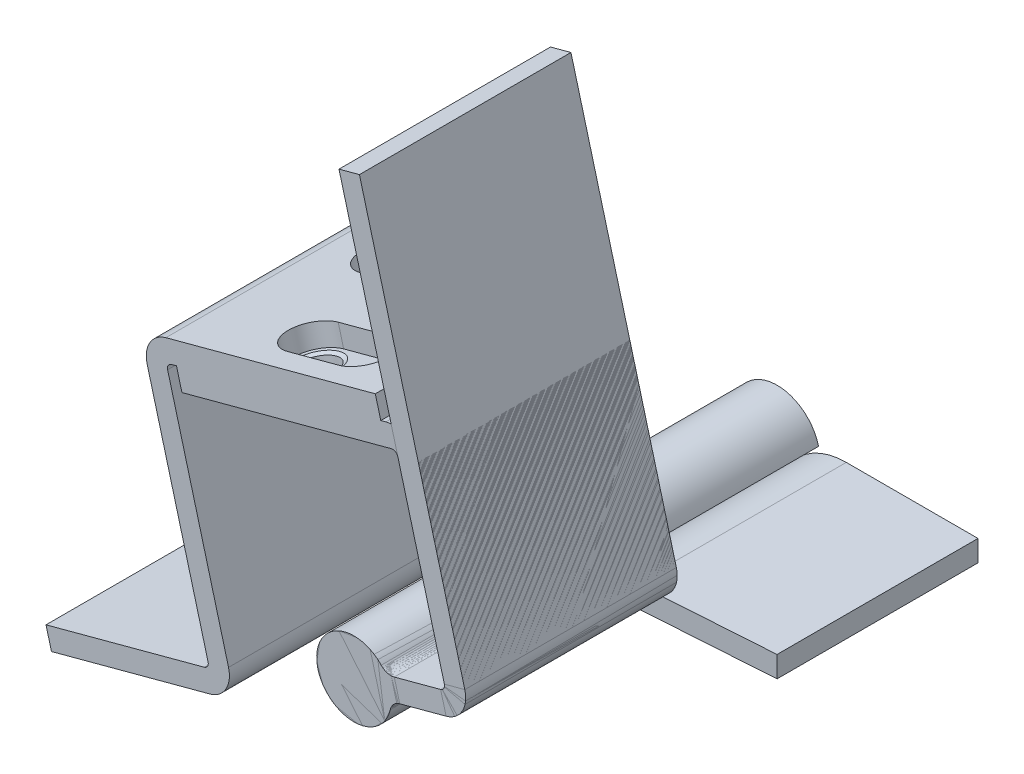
ISO-10303-21;
HEADER;
FILE_DESCRIPTION(('STEP AP214'),'2;1');
FILE_NAME('part.step','',(''),(''),'','','');
FILE_SCHEMA(('AUTOMOTIVE_DESIGN { 1 0 10303 214 1 1 1 1 }'));
ENDSEC;
DATA;
#1=APPLICATION_CONTEXT('core data for automotive mechanical design processes');
#2=APPLICATION_PROTOCOL_DEFINITION('international standard','automotive_design',2000,#1);
#3=PRODUCT_CONTEXT('',#1,'mechanical');
#4=PRODUCT('Part','Part','',(#3));
#5=PRODUCT_RELATED_PRODUCT_CATEGORY('part','',(#4));
#6=PRODUCT_DEFINITION_FORMATION('','',#4);
#7=PRODUCT_DEFINITION_CONTEXT('part definition',#1,'design');
#8=PRODUCT_DEFINITION('design','',#6,#7);
#9=PRODUCT_DEFINITION_SHAPE('','',#8);
#10=(LENGTH_UNIT() NAMED_UNIT(*) SI_UNIT(.MILLI.,.METRE.));
#11=(NAMED_UNIT(*) PLANE_ANGLE_UNIT() SI_UNIT($,.RADIAN.));
#12=(NAMED_UNIT(*) SI_UNIT($,.STERADIAN.) SOLID_ANGLE_UNIT());
#13=UNCERTAINTY_MEASURE_WITH_UNIT(LENGTH_MEASURE(1.E-05),#10,'distance_accuracy_value','');
#14=(GEOMETRIC_REPRESENTATION_CONTEXT(3) GLOBAL_UNCERTAINTY_ASSIGNED_CONTEXT((#13)) GLOBAL_UNIT_ASSIGNED_CONTEXT((#10,
#11,#12)) REPRESENTATION_CONTEXT('',''));
#15=CARTESIAN_POINT('',(0.,0.,0.));
#16=DIRECTION('',(0.,0.,1.));
#17=DIRECTION('',(1.,0.,0.));
#18=AXIS2_PLACEMENT_3D('',#15,#16,#17);
#19=CARTESIAN_POINT('',(-14.676906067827,14.0735929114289,0.));
#20=DIRECTION('',(0.,0.,1.));
#21=DIRECTION('',(1.,0.,0.));
#22=AXIS2_PLACEMENT_3D('',#19,#20,#21);
#23=PLANE('',#22);
#24=DIRECTION('',(0.25881904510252,-0.965925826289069,0.));
#25=VECTOR('',#24,1.);
#26=CARTESIAN_POINT('',(8.29332311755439,40.527407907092,0.));
#27=LINE('',#26,#25);
#28=CARTESIAN_POINT('',(-2.83589582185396,82.062218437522,0.));
#29=VERTEX_POINT('',#28);
#30=CARTESIAN_POINT('',(17.0931706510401,7.68592981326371,0.));
#31=VERTEX_POINT('',#30);
#32=EDGE_CURVE('P0_E134',#29,#31,#27,.T.);
#33=ORIENTED_EDGE('',*,*,#32,.F.);
#34=DIRECTION('',(-0.965925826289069,-0.258819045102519,0.));
#35=VECTOR('',#34,1.);
#36=CARTESIAN_POINT('',(-2.83589582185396,82.062218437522,0.));
#37=LINE('',#36,#35);
#38=CARTESIAN_POINT('',(1.02780748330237,83.0974946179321,0.));
#39=VERTEX_POINT('',#38);
#40=EDGE_CURVE('P0_E120',#39,#29,#37,.T.);
#41=ORIENTED_EDGE('',*,*,#40,.F.);
#42=DIRECTION('',(-0.258819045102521,0.965925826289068,0.));
#43=VECTOR('',#42,1.);
#44=CARTESIAN_POINT('',(20.9568739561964,8.72120599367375,0.));
#45=LINE('',#44,#43);
#46=CARTESIAN_POINT('',(20.9568739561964,8.72120599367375,0.));
#47=VERTEX_POINT('',#46);
#48=EDGE_CURVE('P0_E115',#47,#39,#45,.T.);
#49=ORIENTED_EDGE('',*,*,#48,.F.);
#50=CARTESIAN_POINT('',(16.127244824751,7.42711076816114,0.));
#51=DIRECTION('',(0.,0.,-1.));
#52=DIRECTION('',(-1.,0.,0.));
#53=AXIS2_PLACEMENT_3D('',#50,#51,#52);
#54=CIRCLE('',#53,4.99999999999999);
#55=CARTESIAN_POINT('',(17.4213400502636,2.5974816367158,0.));
#56=VERTEX_POINT('',#55);
#57=EDGE_CURVE('P0_E137',#56,#47,#54,.F.);
#58=ORIENTED_EDGE('',*,*,#57,.F.);
#59=DIRECTION('',(0.965925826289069,0.258819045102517,0.));
#60=VECTOR('',#59,1.);
#61=CARTESIAN_POINT('',(8.65395075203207,0.248266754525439,0.));
#62=LINE('',#61,#60);
#63=CARTESIAN_POINT('',(8.65395075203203,0.248266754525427,0.));
#64=VERTEX_POINT('',#63);
#65=EDGE_CURVE('P0_E138',#64,#56,#62,.T.);
#66=ORIENTED_EDGE('',*,*,#65,.F.);
#67=CARTESIAN_POINT('',(9.30099836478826,-2.16654781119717,0.));
#68=DIRECTION('',(0.,0.,-1.));
#69=DIRECTION('',(-1.,0.,0.));
#70=AXIS2_PLACEMENT_3D('',#67,#68,#69);
#71=CIRCLE('',#70,2.4999999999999);
#72=CARTESIAN_POINT('',(6.86618203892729,-1.59938869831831,0.));
#73=VERTEX_POINT('',#72);
#74=EDGE_CURVE('P0_E172',#64,#73,#71,.F.);
#75=ORIENTED_EDGE('',*,*,#74,.T.);
#76=CARTESIAN_POINT('',(0.,1.9819215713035E-13,0.));
#77=DIRECTION('',(0.,0.,-1.));
#78=DIRECTION('',(-1.,0.,0.));
#79=AXIS2_PLACEMENT_3D('',#76,#77,#78);
#80=CIRCLE('',#79,7.04999999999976);
#81=CARTESIAN_POINT('',(5.14659372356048,4.8182022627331,0.));
#82=VERTEX_POINT('',#81);
#83=EDGE_CURVE('P0_E170',#73,#82,#80,.T.);
#84=ORIENTED_EDGE('',*,*,#83,.T.);
#85=CARTESIAN_POINT('',(6.97162695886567,6.52678462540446,0.));
#86=DIRECTION('',(0.,0.,-1.));
#87=DIRECTION('',(-1.,0.,0.));
#88=AXIS2_PLACEMENT_3D('',#85,#86,#87);
#89=CIRCLE('',#88,2.50000000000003);
#90=CARTESIAN_POINT('',(7.61867457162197,4.11197005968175,0.));
#91=VERTEX_POINT('',#90);
#92=EDGE_CURVE('P0_E41',#82,#91,#89,.F.);
#93=ORIENTED_EDGE('',*,*,#92,.T.);
#94=DIRECTION('',(-0.965925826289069,-0.258819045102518,0.));
#95=VECTOR('',#94,1.);
#96=CARTESIAN_POINT('',(16.3860638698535,6.46118494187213,0.));
#97=LINE('',#96,#95);
#98=CARTESIAN_POINT('',(16.3860638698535,6.46118494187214,0.));
#99=VERTEX_POINT('',#98);
#100=EDGE_CURVE('P0_E130',#99,#91,#97,.T.);
#101=ORIENTED_EDGE('',*,*,#100,.F.);
#102=CARTESIAN_POINT('',(16.127244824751,7.42711076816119,0.));
#103=DIRECTION('',(0.,0.,-1.));
#104=DIRECTION('',(-1.,0.,0.));
#105=AXIS2_PLACEMENT_3D('',#102,#103,#104);
#106=CIRCLE('',#105,0.999999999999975);
#107=EDGE_CURVE('P0_E176',#31,#99,#106,.T.);
#108=ORIENTED_EDGE('',*,*,#107,.F.);
#109=EDGE_LOOP('',(#33,#41,#49,#58,#66,#75,#84,#93,#101,#108));
#110=FACE_BOUND('',#109,.T.);
#111=CARTESIAN_POINT('',(0.,0.,0.));
#112=DIRECTION('',(0.,0.,1.));
#113=DIRECTION('',(1.,0.,0.));
#114=AXIS2_PLACEMENT_3D('',#111,#112,#113);
#115=CIRCLE('',#114,4.1);
#116=CARTESIAN_POINT('',(4.1,0.,0.));
#117=VERTEX_POINT('',#116);
#118=EDGE_CURVE('P0_E133',#117,#117,#115,.F.);
#119=ORIENTED_EDGE('',*,*,#118,.F.);
#120=EDGE_LOOP('',(#119));
#121=FACE_BOUND('',#120,.T.);
#122=ADVANCED_FACE('P0_F26',(#110,#121),#23,.F.);
#123=CARTESIAN_POINT('',(0.,1.9819215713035E-13,40.));
#124=DIRECTION('',(0.,0.,-1.));
#125=DIRECTION('',(-1.,0.,0.));
#126=AXIS2_PLACEMENT_3D('',#123,#124,#125);
#127=CYLINDRICAL_SURFACE('',#126,7.04999999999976);
#128=CARTESIAN_POINT('',(0.,1.9819215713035E-13,40.));
#129=DIRECTION('',(0.,0.,-1.));
#130=DIRECTION('',(-1.,0.,0.));
#131=AXIS2_PLACEMENT_3D('',#128,#129,#130);
#132=CIRCLE('',#131,7.04999999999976);
#133=CARTESIAN_POINT('',(5.14659372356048,4.8182022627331,40.));
#134=VERTEX_POINT('',#133);
#135=CARTESIAN_POINT('',(6.8661820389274,-1.59938869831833,40.));
#136=VERTEX_POINT('',#135);
#137=EDGE_CURVE('P0_E180',#134,#136,#132,.F.);
#138=ORIENTED_EDGE('',*,*,#137,.F.);
#139=DIRECTION('',(0.,0.,-1.));
#140=VECTOR('',#139,1.);
#141=CARTESIAN_POINT('',(5.1465937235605,4.81820226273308,40.));
#142=LINE('',#141,#140);
#143=EDGE_CURVE('P0_E161',#82,#134,#142,.F.);
#144=ORIENTED_EDGE('',*,*,#143,.F.);
#145=ORIENTED_EDGE('',*,*,#83,.F.);
#146=DIRECTION('',(0.,0.,-1.));
#147=VECTOR('',#146,1.);
#148=CARTESIAN_POINT('',(6.86618203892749,-1.59938869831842,40.));
#149=LINE('',#148,#147);
#150=EDGE_CURVE('P0_E128',#136,#73,#149,.T.);
#151=ORIENTED_EDGE('',*,*,#150,.F.);
#152=EDGE_LOOP('',(#138,#144,#145,#151));
#153=FACE_BOUND('',#152,.T.);
#154=ADVANCED_FACE('P0_F203',(#153),#127,.T.);
#155=CARTESIAN_POINT('',(9.30099836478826,-2.16654781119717,40.));
#156=DIRECTION('',(0.,0.,-1.));
#157=DIRECTION('',(-1.,0.,0.));
#158=AXIS2_PLACEMENT_3D('',#155,#156,#157);
#159=CYLINDRICAL_SURFACE('',#158,2.4999999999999);
#160=CARTESIAN_POINT('',(9.30099836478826,-2.16654781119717,40.));
#161=DIRECTION('',(0.,0.,-1.));
#162=DIRECTION('',(-1.,0.,0.));
#163=AXIS2_PLACEMENT_3D('',#160,#161,#162);
#164=CIRCLE('',#163,2.4999999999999);
#165=CARTESIAN_POINT('',(8.65395075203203,0.248266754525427,40.));
#166=VERTEX_POINT('',#165);
#167=EDGE_CURVE('P0_E178',#136,#166,#164,.T.);
#168=ORIENTED_EDGE('',*,*,#167,.F.);
#169=ORIENTED_EDGE('',*,*,#150,.T.);
#170=ORIENTED_EDGE('',*,*,#74,.F.);
#171=DIRECTION('',(0.,0.,1.));
#172=VECTOR('',#171,1.);
#173=CARTESIAN_POINT('',(8.65395075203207,0.248266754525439,40.));
#174=LINE('',#173,#172);
#175=EDGE_CURVE('P0_E153',#166,#64,#174,.F.);
#176=ORIENTED_EDGE('',*,*,#175,.F.);
#177=EDGE_LOOP('',(#168,#169,#170,#176));
#178=FACE_BOUND('',#177,.T.);
#179=ADVANCED_FACE('P0_F208',(#178),#159,.F.);
#180=CARTESIAN_POINT('',(6.97162695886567,6.52678462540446,40.));
#181=DIRECTION('',(0.,0.,-1.));
#182=DIRECTION('',(-1.,0.,0.));
#183=AXIS2_PLACEMENT_3D('',#180,#181,#182);
#184=CYLINDRICAL_SURFACE('',#183,2.50000000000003);
#185=CARTESIAN_POINT('',(6.97162695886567,6.52678462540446,40.));
#186=DIRECTION('',(0.,0.,-1.));
#187=DIRECTION('',(-1.,0.,0.));
#188=AXIS2_PLACEMENT_3D('',#185,#186,#187);
#189=CIRCLE('',#188,2.50000000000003);
#190=CARTESIAN_POINT('',(7.61867457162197,4.11197005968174,40.));
#191=VERTEX_POINT('',#190);
#192=EDGE_CURVE('P0_E163',#191,#134,#189,.T.);
#193=ORIENTED_EDGE('',*,*,#192,.F.);
#194=DIRECTION('',(0.,0.,1.));
#195=VECTOR('',#194,1.);
#196=CARTESIAN_POINT('',(7.61867457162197,4.11197005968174,40.));
#197=LINE('',#196,#195);
#198=EDGE_CURVE('P0_E145',#91,#191,#197,.T.);
#199=ORIENTED_EDGE('',*,*,#198,.F.);
#200=ORIENTED_EDGE('',*,*,#92,.F.);
#201=ORIENTED_EDGE('',*,*,#143,.T.);
#202=EDGE_LOOP('',(#193,#199,#200,#201));
#203=FACE_BOUND('',#202,.T.);
#204=ADVANCED_FACE('P0_F240',(#203),#184,.F.);
#205=CARTESIAN_POINT('',(-14.6769060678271,14.0735929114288,40.));
#206=DIRECTION('',(0.,0.,1.));
#207=DIRECTION('',(1.,0.,0.));
#208=AXIS2_PLACEMENT_3D('',#205,#206,#207);
#209=PLANE('',#208);
#210=DIRECTION('',(-0.258819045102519,0.965925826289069,0.));
#211=VECTOR('',#210,1.);
#212=CARTESIAN_POINT('',(20.9568739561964,8.72120599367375,40.));
#213=LINE('',#212,#211);
#214=CARTESIAN_POINT('',(1.02780748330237,83.0974946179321,40.));
#215=VERTEX_POINT('',#214);
#216=CARTESIAN_POINT('',(20.9568739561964,8.72120599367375,40.));
#217=VERTEX_POINT('',#216);
#218=EDGE_CURVE('P0_E98',#215,#217,#213,.F.);
#219=ORIENTED_EDGE('',*,*,#218,.F.);
#220=DIRECTION('',(-0.965925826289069,-0.258819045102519,0.));
#221=VECTOR('',#220,1.);
#222=CARTESIAN_POINT('',(-2.83589582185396,82.062218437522,40.));
#223=LINE('',#222,#221);
#224=CARTESIAN_POINT('',(-2.83589582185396,82.062218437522,40.));
#225=VERTEX_POINT('',#224);
#226=EDGE_CURVE('P0_E103',#215,#225,#223,.T.);
#227=ORIENTED_EDGE('',*,*,#226,.T.);
#228=DIRECTION('',(0.25881904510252,-0.965925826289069,0.));
#229=VECTOR('',#228,1.);
#230=CARTESIAN_POINT('',(8.29332311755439,40.527407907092,40.));
#231=LINE('',#230,#229);
#232=CARTESIAN_POINT('',(17.0931706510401,7.68592981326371,40.));
#233=VERTEX_POINT('',#232);
#234=EDGE_CURVE('P0_E147',#233,#225,#231,.F.);
#235=ORIENTED_EDGE('',*,*,#234,.F.);
#236=CARTESIAN_POINT('',(16.127244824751,7.42711076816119,40.));
#237=DIRECTION('',(0.,0.,-1.));
#238=DIRECTION('',(-1.,0.,0.));
#239=AXIS2_PLACEMENT_3D('',#236,#237,#238);
#240=CIRCLE('',#239,0.999999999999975);
#241=CARTESIAN_POINT('',(16.3860638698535,6.46118494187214,40.));
#242=VERTEX_POINT('',#241);
#243=EDGE_CURVE('P0_E174',#242,#233,#240,.F.);
#244=ORIENTED_EDGE('',*,*,#243,.F.);
#245=DIRECTION('',(-0.965925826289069,-0.25881904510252,0.));
#246=VECTOR('',#245,1.);
#247=CARTESIAN_POINT('',(16.3860638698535,6.46118494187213,40.));
#248=LINE('',#247,#246);
#249=EDGE_CURVE('P0_E144',#191,#242,#248,.F.);
#250=ORIENTED_EDGE('',*,*,#249,.F.);
#251=ORIENTED_EDGE('',*,*,#192,.T.);
#252=ORIENTED_EDGE('',*,*,#137,.T.);
#253=ORIENTED_EDGE('',*,*,#167,.T.);
#254=DIRECTION('',(0.965925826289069,0.25881904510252,0.));
#255=VECTOR('',#254,1.);
#256=CARTESIAN_POINT('',(8.65395075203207,0.248266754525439,40.));
#257=LINE('',#256,#255);
#258=CARTESIAN_POINT('',(17.4213400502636,2.59748163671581,40.));
#259=VERTEX_POINT('',#258);
#260=EDGE_CURVE('P0_E156',#259,#166,#257,.F.);
#261=ORIENTED_EDGE('',*,*,#260,.F.);
#262=CARTESIAN_POINT('',(16.127244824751,7.42711076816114,40.));
#263=DIRECTION('',(0.,0.,-1.));
#264=DIRECTION('',(-1.,0.,0.));
#265=AXIS2_PLACEMENT_3D('',#262,#263,#264);
#266=CIRCLE('',#265,4.99999999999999);
#267=EDGE_CURVE('P0_E105',#217,#259,#266,.T.);
#268=ORIENTED_EDGE('',*,*,#267,.F.);
#269=EDGE_LOOP('',(#219,#227,#235,#244,#250,#251,#252,#253,#261,#268));
#270=FACE_BOUND('',#269,.T.);
#271=ADVANCED_FACE('P0_F100',(#270),#209,.T.);
#272=CARTESIAN_POINT('',(16.127244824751,7.42711076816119,40.));
#273=DIRECTION('',(0.,0.,-1.));
#274=DIRECTION('',(-1.,0.,0.));
#275=AXIS2_PLACEMENT_3D('',#272,#273,#274);
#276=CYLINDRICAL_SURFACE('',#275,0.999999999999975);
#277=ORIENTED_EDGE('',*,*,#243,.T.);
#278=DIRECTION('',(0.,0.,1.));
#279=VECTOR('',#278,1.);
#280=CARTESIAN_POINT('',(17.0931706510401,7.68592981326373,40.));
#281=LINE('',#280,#279);
#282=EDGE_CURVE('P0_E148',#31,#233,#281,.T.);
#283=ORIENTED_EDGE('',*,*,#282,.F.);
#284=ORIENTED_EDGE('',*,*,#107,.T.);
#285=DIRECTION('',(0.,0.,1.));
#286=VECTOR('',#285,1.);
#287=CARTESIAN_POINT('',(16.3860638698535,6.46118494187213,40.));
#288=LINE('',#287,#286);
#289=EDGE_CURVE('P0_E141',#242,#99,#288,.F.);
#290=ORIENTED_EDGE('',*,*,#289,.F.);
#291=EDGE_LOOP('',(#277,#283,#284,#290));
#292=FACE_BOUND('',#291,.T.);
#293=ADVANCED_FACE('P0_F233',(#292),#276,.F.);
#294=CARTESIAN_POINT('',(8.65395075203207,0.248266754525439,40.));
#295=DIRECTION('',(0.25881904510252,-0.965925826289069,0.));
#296=DIRECTION('',(0.965925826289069,0.25881904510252,0.));
#297=AXIS2_PLACEMENT_3D('',#294,#295,#296);
#298=PLANE('',#297);
#299=ORIENTED_EDGE('',*,*,#260,.T.);
#300=ORIENTED_EDGE('',*,*,#175,.T.);
#301=ORIENTED_EDGE('',*,*,#65,.T.);
#302=DIRECTION('',(0.,0.,-1.));
#303=VECTOR('',#302,1.);
#304=CARTESIAN_POINT('',(17.4213400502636,2.5974816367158,40.));
#305=LINE('',#304,#303);
#306=EDGE_CURVE('P0_E109',#259,#56,#305,.T.);
#307=ORIENTED_EDGE('',*,*,#306,.F.);
#308=EDGE_LOOP('',(#299,#300,#301,#307));
#309=FACE_BOUND('',#308,.T.);
#310=ADVANCED_FACE('P0_F229',(#309),#298,.T.);
#311=CARTESIAN_POINT('',(16.127244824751,7.42711076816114,40.));
#312=DIRECTION('',(0.,0.,-1.));
#313=DIRECTION('',(-1.,0.,0.));
#314=AXIS2_PLACEMENT_3D('',#311,#312,#313);
#315=CYLINDRICAL_SURFACE('',#314,4.99999999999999);
#316=ORIENTED_EDGE('',*,*,#267,.T.);
#317=ORIENTED_EDGE('',*,*,#306,.T.);
#318=ORIENTED_EDGE('',*,*,#57,.T.);
#319=DIRECTION('',(0.,0.,1.));
#320=VECTOR('',#319,1.);
#321=CARTESIAN_POINT('',(20.9568739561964,8.72120599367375,40.));
#322=LINE('',#321,#320);
#323=EDGE_CURVE('P0_E108',#217,#47,#322,.F.);
#324=ORIENTED_EDGE('',*,*,#323,.F.);
#325=EDGE_LOOP('',(#316,#317,#318,#324));
#326=FACE_BOUND('',#325,.T.);
#327=ADVANCED_FACE('P0_F226',(#326),#315,.T.);
#328=CARTESIAN_POINT('',(20.9568739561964,8.72120599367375,40.));
#329=DIRECTION('',(0.965925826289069,0.258819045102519,0.));
#330=DIRECTION('',(-0.258819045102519,0.965925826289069,0.));
#331=AXIS2_PLACEMENT_3D('',#328,#329,#330);
#332=PLANE('',#331);
#333=ORIENTED_EDGE('',*,*,#48,.T.);
#334=DIRECTION('',(0.,0.,1.));
#335=VECTOR('',#334,1.);
#336=CARTESIAN_POINT('',(1.02780748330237,83.0974946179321,0.));
#337=LINE('',#336,#335);
#338=EDGE_CURVE('P0_E112',#39,#215,#337,.T.);
#339=ORIENTED_EDGE('',*,*,#338,.T.);
#340=ORIENTED_EDGE('',*,*,#218,.T.);
#341=ORIENTED_EDGE('',*,*,#323,.T.);
#342=EDGE_LOOP('',(#333,#339,#340,#341));
#343=FACE_BOUND('',#342,.T.);
#344=ADVANCED_FACE('P0_F113',(#343),#332,.T.);
#345=CARTESIAN_POINT('',(8.29332311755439,40.527407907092,40.));
#346=DIRECTION('',(-0.965925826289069,-0.25881904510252,0.));
#347=DIRECTION('',(0.25881904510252,-0.965925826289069,0.));
#348=AXIS2_PLACEMENT_3D('',#345,#346,#347);
#349=PLANE('',#348);
#350=ORIENTED_EDGE('',*,*,#234,.T.);
#351=DIRECTION('',(0.,0.,1.));
#352=VECTOR('',#351,1.);
#353=CARTESIAN_POINT('',(-2.83589582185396,82.062218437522,0.));
#354=LINE('',#353,#352);
#355=EDGE_CURVE('P0_E119',#29,#225,#354,.T.);
#356=ORIENTED_EDGE('',*,*,#355,.F.);
#357=ORIENTED_EDGE('',*,*,#32,.T.);
#358=ORIENTED_EDGE('',*,*,#282,.T.);
#359=EDGE_LOOP('',(#350,#356,#357,#358));
#360=FACE_BOUND('',#359,.T.);
#361=ADVANCED_FACE('P0_F213',(#360),#349,.T.);
#362=CARTESIAN_POINT('',(16.3860638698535,6.46118494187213,40.));
#363=DIRECTION('',(-0.25881904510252,0.965925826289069,0.));
#364=DIRECTION('',(-0.965925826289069,-0.25881904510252,0.));
#365=AXIS2_PLACEMENT_3D('',#362,#363,#364);
#366=PLANE('',#365);
#367=ORIENTED_EDGE('',*,*,#249,.T.);
#368=ORIENTED_EDGE('',*,*,#289,.T.);
#369=ORIENTED_EDGE('',*,*,#100,.T.);
#370=ORIENTED_EDGE('',*,*,#198,.T.);
#371=EDGE_LOOP('',(#367,#368,#369,#370));
#372=FACE_BOUND('',#371,.T.);
#373=ADVANCED_FACE('P0_F204',(#372),#366,.T.);
#374=CARTESIAN_POINT('',(0.,0.,-40.));
#375=DIRECTION('',(0.,0.,1.));
#376=DIRECTION('',(1.,0.,0.));
#377=AXIS2_PLACEMENT_3D('',#374,#375,#376);
#378=CYLINDRICAL_SURFACE('',#377,4.1);
#379=CARTESIAN_POINT('',(0.,0.,-39.));
#380=DIRECTION('',(0.,0.,-1.));
#381=DIRECTION('',(-1.,0.,0.));
#382=AXIS2_PLACEMENT_3D('',#379,#380,#381);
#383=CIRCLE('',#382,4.1);
#384=CARTESIAN_POINT('',(-4.1,0.,-39.));
#385=VERTEX_POINT('',#384);
#386=EDGE_CURVE('P0_E11',#385,#385,#383,.F.);
#387=ORIENTED_EDGE('',*,*,#386,.T.);
#388=EDGE_LOOP('',(#387));
#389=FACE_BOUND('',#388,.T.);
#390=ORIENTED_EDGE('',*,*,#118,.T.);
#391=EDGE_LOOP('',(#390));
#392=FACE_BOUND('',#391,.T.);
#393=ADVANCED_FACE('P0_F199',(#389,#392),#378,.T.);
#394=CARTESIAN_POINT('',(0.,0.,-40.));
#395=DIRECTION('',(0.,0.,-1.));
#396=DIRECTION('',(-1.,0.,0.));
#397=AXIS2_PLACEMENT_3D('',#394,#395,#396);
#398=PLANE('',#397);
#399=CARTESIAN_POINT('',(0.,0.,-40.));
#400=DIRECTION('',(0.,0.,-1.));
#401=DIRECTION('',(-1.,0.,0.));
#402=AXIS2_PLACEMENT_3D('',#399,#400,#401);
#403=CIRCLE('',#402,3.1);
#404=CARTESIAN_POINT('',(-3.1,0.,-40.));
#405=VERTEX_POINT('',#404);
#406=EDGE_CURVE('P0_E34',#405,#405,#403,.T.);
#407=ORIENTED_EDGE('',*,*,#406,.T.);
#408=EDGE_LOOP('',(#407));
#409=FACE_BOUND('',#408,.T.);
#410=ADVANCED_FACE('P0_F188',(#409),#398,.T.);
#411=CARTESIAN_POINT('',(0.,0.,-40.));
#412=DIRECTION('',(0.,0.,1.));
#413=DIRECTION('',(1.,0.,0.));
#414=AXIS2_PLACEMENT_3D('',#411,#412,#413);
#415=CONICAL_SURFACE('',#414,3.1,0.785398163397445);
#416=ORIENTED_EDGE('',*,*,#386,.F.);
#417=EDGE_LOOP('',(#416));
#418=FACE_BOUND('',#417,.T.);
#419=ORIENTED_EDGE('',*,*,#406,.F.);
#420=EDGE_LOOP('',(#419));
#421=FACE_BOUND('',#420,.T.);
#422=ADVANCED_FACE('P0_F190',(#418,#421),#415,.T.);
#423=CARTESIAN_POINT('',(-2.83589582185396,82.062218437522,0.));
#424=DIRECTION('',(-0.258819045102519,0.965925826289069,0.));
#425=DIRECTION('',(-0.965925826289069,-0.258819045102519,0.));
#426=AXIS2_PLACEMENT_3D('',#423,#424,#425);
#427=PLANE('',#426);
#428=ORIENTED_EDGE('',*,*,#226,.F.);
#429=ORIENTED_EDGE('',*,*,#338,.F.);
#430=ORIENTED_EDGE('',*,*,#40,.T.);
#431=ORIENTED_EDGE('',*,*,#355,.T.);
#432=EDGE_LOOP('',(#428,#429,#430,#431));
#433=FACE_BOUND('',#432,.T.);
#434=ADVANCED_FACE('P0_F123',(#433),#427,.T.);
#435=CLOSED_SHELL('',(#122,#154,#179,#204,#271,#293,#310,#327,#344,#361,#373,#393,#410,#422,#434));
#436=MANIFOLD_SOLID_BREP('P0_B2',#435);
#437=CARTESIAN_POINT('',(-9.88342000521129,36.69224044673,19.9999999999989));
#438=DIRECTION('',(0.258819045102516,-0.96592582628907,0.));
#439=DIRECTION('',(0.96592582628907,0.258819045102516,0.));
#440=AXIS2_PLACEMENT_3D('',#437,#438,#439);
#441=PLANE('',#440);
#442=CARTESIAN_POINT('',(-9.88342000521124,36.69224044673,19.9999999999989));
#443=DIRECTION('',(0.258819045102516,-0.96592582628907,0.));
#444=DIRECTION('',(0.96592582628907,0.258819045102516,0.));
#445=AXIS2_PLACEMENT_3D('',#442,#443,#444);
#446=CIRCLE('',#445,3.32499999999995);
#447=CARTESIAN_POINT('',(-6.67171663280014,37.5528137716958,19.9999999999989));
#448=VERTEX_POINT('',#447);
#449=EDGE_CURVE('P1_E20',#448,#448,#446,.F.);
#450=ORIENTED_EDGE('',*,*,#449,.F.);
#451=EDGE_LOOP('',(#450));
#452=FACE_BOUND('',#451,.T.);
#453=ADVANCED_FACE('P1_F16',(#452),#441,.T.);
#454=CARTESIAN_POINT('',(-10.9186961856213,40.5559437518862,19.9999999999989));
#455=DIRECTION('',(0.258819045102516,-0.96592582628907,0.));
#456=DIRECTION('',(0.96592582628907,0.258819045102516,0.));
#457=AXIS2_PLACEMENT_3D('',#454,#455,#456);
#458=CYLINDRICAL_SURFACE('',#457,3.32499999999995);
#459=CARTESIAN_POINT('',(-10.9186961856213,40.5559437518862,19.9999999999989));
#460=DIRECTION('',(0.258819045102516,-0.96592582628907,0.));
#461=DIRECTION('',(0.96592582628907,0.258819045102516,0.));
#462=AXIS2_PLACEMENT_3D('',#459,#460,#461);
#463=CIRCLE('',#462,3.32499999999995);
#464=CARTESIAN_POINT('',(-7.70699281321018,41.416517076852,19.9999999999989));
#465=VERTEX_POINT('',#464);
#466=EDGE_CURVE('P1_E500',#465,#465,#463,.F.);
#467=ORIENTED_EDGE('',*,*,#466,.F.);
#468=EDGE_LOOP('',(#467));
#469=FACE_BOUND('',#468,.T.);
#470=ORIENTED_EDGE('',*,*,#449,.T.);
#471=EDGE_LOOP('',(#470));
#472=FACE_BOUND('',#471,.T.);
#473=ADVANCED_FACE('P1_F512',(#469,#472),#458,.T.);
#474=CARTESIAN_POINT('',(-11.8504447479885,44.0332767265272,20.0000000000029));
#475=DIRECTION('',(-0.258819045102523,0.965925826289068,0.));
#476=DIRECTION('',(-0.965925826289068,-0.258819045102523,0.));
#477=AXIS2_PLACEMENT_3D('',#474,#475,#476);
#478=PLANE('',#477);
#479=CARTESIAN_POINT('',(-11.8504447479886,44.0332767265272,20.0000000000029));
#480=DIRECTION('',(0.258819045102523,-0.965925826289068,0.));
#481=DIRECTION('',(0.965925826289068,0.258819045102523,0.));
#482=AXIS2_PLACEMENT_3D('',#479,#480,#481);
#483=CIRCLE('',#482,3.32499999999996);
#484=CARTESIAN_POINT('',(-8.63874137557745,44.8938500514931,20.0000000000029));
#485=VERTEX_POINT('',#484);
#486=EDGE_CURVE('P1_E492',#485,#485,#483,.F.);
#487=ORIENTED_EDGE('',*,*,#486,.T.);
#488=EDGE_LOOP('',(#487));
#489=FACE_BOUND('',#488,.T.);
#490=ADVANCED_FACE('P1_F515',(#489),#478,.T.);
#491=CARTESIAN_POINT('',(-19.1290657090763,38.3559818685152,9.00000000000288));
#492=DIRECTION('',(-0.258819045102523,0.965925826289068,0.));
#493=DIRECTION('',(-0.965925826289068,-0.258819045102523,0.));
#494=AXIS2_PLACEMENT_3D('',#491,#492,#493);
#495=PLANE('',#494);
#496=DIRECTION('',(-0.965925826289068,-0.258819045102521,0.));
#497=VECTOR('',#496,1.);
#498=CARTESIAN_POINT('',(-14.299436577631,39.6500770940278,4.20000000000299));
#499=LINE('',#498,#497);
#500=CARTESIAN_POINT('',(-14.299436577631,39.6500770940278,4.20000000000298));
#501=VERTEX_POINT('',#500);
#502=CARTESIAN_POINT('',(-23.9586948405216,37.0618866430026,4.20000000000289));
#503=VERTEX_POINT('',#502);
#504=EDGE_CURVE('P1_E702',#501,#503,#499,.T.);
#505=ORIENTED_EDGE('',*,*,#504,.T.);
#506=CARTESIAN_POINT('',(-23.9586948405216,37.0618866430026,9.00000000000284));
#507=DIRECTION('',(0.258819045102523,-0.965925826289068,0.));
#508=DIRECTION('',(0.965925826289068,0.258819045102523,0.));
#509=AXIS2_PLACEMENT_3D('',#506,#507,#508);
#510=CIRCLE('',#509,4.79999999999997);
#511=CARTESIAN_POINT('',(-23.9586948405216,37.0618866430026,13.8000000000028));
#512=VERTEX_POINT('',#511);
#513=EDGE_CURVE('P1_E487',#503,#512,#510,.F.);
#514=ORIENTED_EDGE('',*,*,#513,.T.);
#515=DIRECTION('',(0.965925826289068,0.258819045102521,0.));
#516=VECTOR('',#515,1.);
#517=CARTESIAN_POINT('',(-23.9586948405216,37.0618866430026,13.8000000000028));
#518=LINE('',#517,#516);
#519=CARTESIAN_POINT('',(-14.299436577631,39.6500770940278,13.8000000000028));
#520=VERTEX_POINT('',#519);
#521=EDGE_CURVE('P1_E495',#512,#520,#518,.T.);
#522=ORIENTED_EDGE('',*,*,#521,.T.);
#523=CARTESIAN_POINT('',(-14.299436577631,39.6500770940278,9.00000000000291));
#524=DIRECTION('',(0.258819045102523,-0.965925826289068,0.));
#525=DIRECTION('',(0.965925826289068,0.258819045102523,0.));
#526=AXIS2_PLACEMENT_3D('',#523,#524,#525);
#527=CIRCLE('',#526,4.79999999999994);
#528=EDGE_CURVE('P1_E482',#520,#501,#527,.F.);
#529=ORIENTED_EDGE('',*,*,#528,.T.);
#530=EDGE_LOOP('',(#505,#514,#522,#529));
#531=FACE_BOUND('',#530,.T.);
#532=CARTESIAN_POINT('',(-23.9586948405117,37.0618866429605,9.00000000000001));
#533=DIRECTION('',(-0.258819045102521,0.965925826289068,0.));
#534=DIRECTION('',(-0.965925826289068,-0.258819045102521,0.));
#535=AXIS2_PLACEMENT_3D('',#532,#533,#534);
#536=CIRCLE('',#535,3.99999999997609);
#537=CARTESIAN_POINT('',(-27.8223981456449,36.0266104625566,9.00000000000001));
#538=VERTEX_POINT('',#537);
#539=EDGE_CURVE('P1_E505',#538,#538,#536,.F.);
#540=ORIENTED_EDGE('',*,*,#539,.T.);
#541=EDGE_LOOP('',(#540));
#542=FACE_BOUND('',#541,.T.);
#543=ADVANCED_FACE('P1_F692',(#531,#542),#495,.T.);
#544=CARTESIAN_POINT('',(-10.9186961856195,40.5559437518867,31.0000000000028));
#545=DIRECTION('',(-0.258819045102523,0.965925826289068,0.));
#546=DIRECTION('',(-0.965925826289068,-0.258819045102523,0.));
#547=AXIS2_PLACEMENT_3D('',#544,#545,#546);
#548=PLANE('',#547);
#549=DIRECTION('',(-0.965925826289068,-0.258819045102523,0.));
#550=VECTOR('',#549,1.);
#551=CARTESIAN_POINT('',(-6.08906705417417,41.8500389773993,26.2000000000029));
#552=LINE('',#551,#550);
#553=CARTESIAN_POINT('',(-6.08906705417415,41.8500389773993,26.2000000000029));
#554=VERTEX_POINT('',#553);
#555=CARTESIAN_POINT('',(-15.7483253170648,39.2618485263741,26.2000000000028));
#556=VERTEX_POINT('',#555);
#557=EDGE_CURVE('P1_E888',#554,#556,#552,.T.);
#558=ORIENTED_EDGE('',*,*,#557,.T.);
#559=CARTESIAN_POINT('',(-15.7483253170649,39.2618485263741,31.0000000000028));
#560=DIRECTION('',(0.258819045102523,-0.965925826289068,0.));
#561=DIRECTION('',(0.965925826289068,0.258819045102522,0.));
#562=AXIS2_PLACEMENT_3D('',#559,#560,#561);
#563=CIRCLE('',#562,4.79999999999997);
#564=CARTESIAN_POINT('',(-15.7483253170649,39.2618485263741,35.8000000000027));
#565=VERTEX_POINT('',#564);
#566=EDGE_CURVE('P1_E477',#556,#565,#563,.F.);
#567=ORIENTED_EDGE('',*,*,#566,.T.);
#568=DIRECTION('',(0.965925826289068,0.258819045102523,0.));
#569=VECTOR('',#568,1.);
#570=CARTESIAN_POINT('',(-15.7483253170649,39.2618485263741,35.8000000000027));
#571=LINE('',#570,#569);
#572=CARTESIAN_POINT('',(-6.08906705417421,41.8500389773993,35.8000000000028));
#573=VERTEX_POINT('',#572);
#574=EDGE_CURVE('P1_E485',#565,#573,#571,.T.);
#575=ORIENTED_EDGE('',*,*,#574,.T.);
#576=CARTESIAN_POINT('',(-6.08906705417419,41.8500389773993,31.0000000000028));
#577=DIRECTION('',(0.258819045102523,-0.965925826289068,0.));
#578=DIRECTION('',(0.965925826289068,0.258819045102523,0.));
#579=AXIS2_PLACEMENT_3D('',#576,#577,#578);
#580=CIRCLE('',#579,4.79999999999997);
#581=EDGE_CURVE('P1_E473',#573,#554,#580,.F.);
#582=ORIENTED_EDGE('',*,*,#581,.T.);
#583=EDGE_LOOP('',(#558,#567,#575,#582));
#584=FACE_BOUND('',#583,.T.);
#585=CARTESIAN_POINT('',(-15.7483253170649,39.2618485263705,31.));
#586=DIRECTION('',(-0.258819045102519,0.965925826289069,0.));
#587=DIRECTION('',(-0.965925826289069,-0.258819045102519,0.));
#588=AXIS2_PLACEMENT_3D('',#585,#586,#587);
#589=CIRCLE('',#588,4.00000000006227);
#590=CARTESIAN_POINT('',(-19.6120286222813,38.2265723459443,31.));
#591=VERTEX_POINT('',#590);
#592=EDGE_CURVE('P1_E503',#591,#591,#589,.F.);
#593=ORIENTED_EDGE('',*,*,#592,.T.);
#594=EDGE_LOOP('',(#593));
#595=FACE_BOUND('',#594,.T.);
#596=ADVANCED_FACE('P1_F689',(#584,#595),#548,.T.);
#597=CARTESIAN_POINT('',(-23.9586948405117,37.0618866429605,9.00000000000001));
#598=DIRECTION('',(-0.258819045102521,0.965925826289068,0.));
#599=DIRECTION('',(-0.965925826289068,-0.258819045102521,0.));
#600=AXIS2_PLACEMENT_3D('',#597,#598,#599);
#601=CONICAL_SURFACE('',#600,3.99999999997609,1.0471975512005);
#602=CARTESIAN_POINT('',(-23.8578300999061,36.685454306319,8.99999999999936));
#603=DIRECTION('',(-0.258819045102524,0.965925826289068,0.));
#604=DIRECTION('',(0.933012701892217,0.250000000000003,-0.258819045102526));
#605=AXIS2_PLACEMENT_3D('',#602,#603,#604);
#606=CIRCLE('',#605,3.32499999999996);
#607=CARTESIAN_POINT('',(-20.7555628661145,37.516704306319,8.13942667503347));
#608=VERTEX_POINT('',#607);
#609=EDGE_CURVE('P1_E945',#608,#608,#606,.F.);
#610=ORIENTED_EDGE('',*,*,#609,.T.);
#611=EDGE_LOOP('',(#610));
#612=FACE_BOUND('',#611,.T.);
#613=ORIENTED_EDGE('',*,*,#539,.F.);
#614=EDGE_LOOP('',(#613));
#615=FACE_BOUND('',#614,.T.);
#616=ADVANCED_FACE('P1_F686',(#612,#615),#601,.F.);
#617=CARTESIAN_POINT('',(-15.7483253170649,39.2618485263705,31.));
#618=DIRECTION('',(-0.258819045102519,0.965925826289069,0.));
#619=DIRECTION('',(-0.965925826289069,-0.258819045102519,0.));
#620=AXIS2_PLACEMENT_3D('',#617,#618,#619);
#621=CONICAL_SURFACE('',#620,4.00000000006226,1.0471975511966);
#622=ORIENTED_EDGE('',*,*,#592,.F.);
#623=EDGE_LOOP('',(#622));
#624=FACE_BOUND('',#623,.T.);
#625=CARTESIAN_POINT('',(-15.6474605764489,38.8854161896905,30.9999999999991));
#626=DIRECTION('',(-0.258819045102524,0.965925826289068,0.));
#627=DIRECTION('',(0.933012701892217,0.250000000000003,-0.258819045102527));
#628=AXIS2_PLACEMENT_3D('',#625,#626,#627);
#629=CIRCLE('',#628,3.32499999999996);
#630=CARTESIAN_POINT('',(-12.5451933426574,39.7166661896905,30.1394266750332));
#631=VERTEX_POINT('',#630);
#632=EDGE_CURVE('P1_E947',#631,#631,#629,.F.);
#633=ORIENTED_EDGE('',*,*,#632,.T.);
#634=EDGE_LOOP('',(#633));
#635=FACE_BOUND('',#634,.T.);
#636=ADVANCED_FACE('P1_F683',(#624,#635),#621,.F.);
#637=CARTESIAN_POINT('',(-15.7483253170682,39.2618485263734,19.9999999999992));
#638=DIRECTION('',(0.258819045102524,-0.965925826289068,0.));
#639=DIRECTION('',(0.965925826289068,0.258819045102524,0.));
#640=AXIS2_PLACEMENT_3D('',#637,#638,#639);
#641=PLANE('',#640);
#642=DIRECTION('',(0.965925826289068,0.258819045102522,0.));
#643=VECTOR('',#642,1.);
#644=CARTESIAN_POINT('',(-20.5779544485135,37.9677533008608,16.4999999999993));
#645=LINE('',#644,#643);
#646=CARTESIAN_POINT('',(-20.5779544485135,37.9677533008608,16.4999999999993));
#647=VERTEX_POINT('',#646);
#648=CARTESIAN_POINT('',(-10.9186961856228,40.555943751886,16.4999999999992));
#649=VERTEX_POINT('',#648);
#650=EDGE_CURVE('P1_E851',#647,#649,#645,.T.);
#651=ORIENTED_EDGE('',*,*,#650,.T.);
#652=CARTESIAN_POINT('',(-10.9186961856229,40.555943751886,19.9999999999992));
#653=DIRECTION('',(-0.258819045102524,0.965925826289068,0.));
#654=DIRECTION('',(-0.965925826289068,-0.258819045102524,0.));
#655=AXIS2_PLACEMENT_3D('',#652,#653,#654);
#656=CIRCLE('',#655,3.49999999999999);
#657=CARTESIAN_POINT('',(-10.9186961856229,40.555943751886,23.4999999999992));
#658=VERTEX_POINT('',#657);
#659=EDGE_CURVE('P1_E463',#649,#658,#656,.F.);
#660=ORIENTED_EDGE('',*,*,#659,.T.);
#661=DIRECTION('',(-0.965925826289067,-0.258819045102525,0.));
#662=VECTOR('',#661,1.);
#663=CARTESIAN_POINT('',(-10.9186961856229,40.555943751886,23.4999999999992));
#664=LINE('',#663,#662);
#665=CARTESIAN_POINT('',(-20.5779544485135,37.9677533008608,23.4999999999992));
#666=VERTEX_POINT('',#665);
#667=EDGE_CURVE('P1_E858',#658,#666,#664,.T.);
#668=ORIENTED_EDGE('',*,*,#667,.T.);
#669=CARTESIAN_POINT('',(-20.5779544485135,37.9677533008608,19.9999999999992));
#670=DIRECTION('',(-0.258819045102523,0.965925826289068,0.));
#671=DIRECTION('',(-0.965925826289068,-0.258819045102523,0.));
#672=AXIS2_PLACEMENT_3D('',#669,#670,#671);
#673=CIRCLE('',#672,3.49999999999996);
#674=EDGE_CURVE('P1_E459',#666,#647,#673,.F.);
#675=ORIENTED_EDGE('',*,*,#674,.T.);
#676=EDGE_LOOP('',(#651,#660,#668,#675));
#677=FACE_BOUND('',#676,.T.);
#678=ORIENTED_EDGE('',*,*,#466,.T.);
#679=EDGE_LOOP('',(#678));
#680=FACE_BOUND('',#679,.T.);
#681=ADVANCED_FACE('P1_F680',(#677,#680),#641,.T.);
#682=CARTESIAN_POINT('',(0.,1.9819215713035E-13,40.));
#683=DIRECTION('',(0.,0.,-1.));
#684=DIRECTION('',(-1.,0.,0.));
#685=AXIS2_PLACEMENT_3D('',#682,#683,#684);
#686=CYLINDRICAL_SURFACE('',#685,7.04999999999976);
#687=CARTESIAN_POINT('',(0.,1.9819215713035E-13,40.));
#688=DIRECTION('',(0.,0.,-1.));
#689=DIRECTION('',(-1.,0.,0.));
#690=AXIS2_PLACEMENT_3D('',#687,#688,#689);
#691=CIRCLE('',#690,7.04999999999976);
#692=CARTESIAN_POINT('',(5.14659372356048,4.8182022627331,40.));
#693=VERTEX_POINT('',#692);
#694=CARTESIAN_POINT('',(6.8661820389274,-1.59938869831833,40.));
#695=VERTEX_POINT('',#694);
#696=EDGE_CURVE('P1_E441',#693,#695,#691,.F.);
#697=ORIENTED_EDGE('',*,*,#696,.F.);
#698=DIRECTION('',(0.,0.,-1.));
#699=VECTOR('',#698,1.);
#700=CARTESIAN_POINT('',(5.1465937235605,4.81820226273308,40.));
#701=LINE('',#700,#699);
#702=CARTESIAN_POINT('',(5.14659372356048,4.8182022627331,0.));
#703=VERTEX_POINT('',#702);
#704=EDGE_CURVE('P1_E456',#703,#693,#701,.F.);
#705=ORIENTED_EDGE('',*,*,#704,.F.);
#706=CARTESIAN_POINT('',(0.,1.9819215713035E-13,0.));
#707=DIRECTION('',(0.,0.,-1.));
#708=DIRECTION('',(-1.,0.,0.));
#709=AXIS2_PLACEMENT_3D('',#706,#707,#708);
#710=CIRCLE('',#709,7.04999999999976);
#711=CARTESIAN_POINT('',(6.86618203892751,-1.59938869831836,0.));
#712=VERTEX_POINT('',#711);
#713=EDGE_CURVE('P1_E428',#712,#703,#710,.T.);
#714=ORIENTED_EDGE('',*,*,#713,.F.);
#715=DIRECTION('',(0.,0.,-1.));
#716=VECTOR('',#715,1.);
#717=CARTESIAN_POINT('',(6.86618203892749,-1.59938869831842,40.));
#718=LINE('',#717,#716);
#719=EDGE_CURVE('P1_E498',#695,#712,#718,.T.);
#720=ORIENTED_EDGE('',*,*,#719,.F.);
#721=EDGE_LOOP('',(#697,#705,#714,#720));
#722=FACE_BOUND('',#721,.T.);
#723=ADVANCED_FACE('P1_F677',(#722),#686,.T.);
#724=CARTESIAN_POINT('',(23.5332962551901,-2.00000000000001,-0.516703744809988));
#725=DIRECTION('',(0.,1.,0.));
#726=DIRECTION('',(0.,0.,1.));
#727=AXIS2_PLACEMENT_3D('',#724,#725,#726);
#728=PLANE('',#727);
#729=DIRECTION('',(-0.997770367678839,0.,0.0667404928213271));
#730=VECTOR('',#729,1.);
#731=CARTESIAN_POINT('',(8.10000000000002,-2.00000000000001,0.));
#732=LINE('',#731,#730);
#733=CARTESIAN_POINT('',(13.0923641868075,-2.00000000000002,-0.333937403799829));
#734=VERTEX_POINT('',#733);
#735=CARTESIAN_POINT('',(8.10000000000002,-2.00000000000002,0.));
#736=VERTEX_POINT('',#735);
#737=EDGE_CURVE('P1_E927',#734,#736,#732,.T.);
#738=ORIENTED_EDGE('',*,*,#737,.T.);
#739=DIRECTION('',(1.,0.,0.));
#740=VECTOR('',#739,1.);
#741=CARTESIAN_POINT('',(11.1225440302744,-2.00000000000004,0.));
#742=LINE('',#741,#740);
#743=CARTESIAN_POINT('',(13.0923641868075,-2.00000000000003,0.));
#744=VERTEX_POINT('',#743);
#745=EDGE_CURVE('P1_E266',#744,#736,#742,.F.);
#746=ORIENTED_EDGE('',*,*,#745,.F.);
#747=DIRECTION('',(0.,0.,-1.));
#748=VECTOR('',#747,1.);
#749=CARTESIAN_POINT('',(13.0923641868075,-2.00000000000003,0.));
#750=LINE('',#749,#748);
#751=EDGE_CURVE('P1_E433',#734,#744,#750,.F.);
#752=ORIENTED_EDGE('',*,*,#751,.F.);
#753=EDGE_LOOP('',(#738,#746,#752));
#754=FACE_BOUND('',#753,.T.);
#755=ADVANCED_FACE('P1_F674',(#754),#728,.T.);
#756=CARTESIAN_POINT('',(13.0923641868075,-2.00000000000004,0.));
#757=DIRECTION('',(0.,-1.,0.));
#758=DIRECTION('',(0.,0.,-1.));
#759=AXIS2_PLACEMENT_3D('',#756,#757,#758);
#760=PLANE('',#759);
#761=DIRECTION('',(1.,0.,0.));
#762=VECTOR('',#761,1.);
#763=CARTESIAN_POINT('',(11.1225440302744,-2.00000000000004,-40.));
#764=LINE('',#763,#762);
#765=CARTESIAN_POINT('',(13.0923641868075,-2.00000000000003,-40.));
#766=VERTEX_POINT('',#765);
#767=CARTESIAN_POINT('',(38.,-2.00000000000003,-40.));
#768=VERTEX_POINT('',#767);
#769=EDGE_CURVE('P1_E421',#766,#768,#764,.T.);
#770=ORIENTED_EDGE('',*,*,#769,.T.);
#771=DIRECTION('',(0.,0.,-1.));
#772=VECTOR('',#771,1.);
#773=CARTESIAN_POINT('',(38.,-2.00000000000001,0.));
#774=LINE('',#773,#772);
#775=CARTESIAN_POINT('',(38.,-2.00000000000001,-2.));
#776=VERTEX_POINT('',#775);
#777=EDGE_CURVE('P1_E499',#776,#768,#774,.T.);
#778=ORIENTED_EDGE('',*,*,#777,.F.);
#779=DIRECTION('',(-0.997770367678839,0.,0.0667404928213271));
#780=VECTOR('',#779,1.);
#781=CARTESIAN_POINT('',(8.10000000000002,-2.00000000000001,0.));
#782=LINE('',#781,#780);
#783=EDGE_CURVE('P1_E922',#776,#734,#782,.T.);
#784=ORIENTED_EDGE('',*,*,#783,.T.);
#785=DIRECTION('',(0.,0.,-1.));
#786=VECTOR('',#785,1.);
#787=CARTESIAN_POINT('',(13.0923641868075,-2.00000000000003,0.));
#788=LINE('',#787,#786);
#789=EDGE_CURVE('P1_E436',#766,#734,#788,.F.);
#790=ORIENTED_EDGE('',*,*,#789,.F.);
#791=EDGE_LOOP('',(#770,#778,#784,#790));
#792=FACE_BOUND('',#791,.T.);
#793=ADVANCED_FACE('P1_F671',(#792),#760,.T.);
#794=CARTESIAN_POINT('',(38.,0.,0.));
#795=DIRECTION('',(1.,0.,0.));
#796=DIRECTION('',(0.,0.,-1.));
#797=AXIS2_PLACEMENT_3D('',#794,#795,#796);
#798=PLANE('',#797);
#799=DIRECTION('',(0.,1.,0.));
#800=VECTOR('',#799,1.);
#801=CARTESIAN_POINT('',(38.,-0.0553838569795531,-40.));
#802=LINE('',#801,#800);
#803=CARTESIAN_POINT('',(38.,2.,-40.));
#804=VERTEX_POINT('',#803);
#805=EDGE_CURVE('P1_E417',#768,#804,#802,.T.);
#806=ORIENTED_EDGE('',*,*,#805,.T.);
#807=DIRECTION('',(0.,0.,1.));
#808=VECTOR('',#807,1.);
#809=CARTESIAN_POINT('',(38.,2.,0.));
#810=LINE('',#809,#808);
#811=CARTESIAN_POINT('',(38.,2.,-2.));
#812=VERTEX_POINT('',#811);
#813=EDGE_CURVE('P1_E832',#812,#804,#810,.F.);
#814=ORIENTED_EDGE('',*,*,#813,.F.);
#815=DIRECTION('',(0.,1.,0.));
#816=VECTOR('',#815,1.);
#817=CARTESIAN_POINT('',(38.,-2.00000000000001,-2.));
#818=LINE('',#817,#816);
#819=EDGE_CURVE('P1_E919',#812,#776,#818,.F.);
#820=ORIENTED_EDGE('',*,*,#819,.T.);
#821=ORIENTED_EDGE('',*,*,#777,.T.);
#822=EDGE_LOOP('',(#806,#814,#820,#821));
#823=FACE_BOUND('',#822,.T.);
#824=ADVANCED_FACE('P1_F668',(#823),#798,.T.);
#825=CARTESIAN_POINT('',(0.,0.,-40.));
#826=DIRECTION('',(0.,0.,1.));
#827=DIRECTION('',(1.,0.,0.));
#828=AXIS2_PLACEMENT_3D('',#825,#826,#827);
#829=PLANE('',#828);
#830=CARTESIAN_POINT('',(0.,0.,-40.));
#831=DIRECTION('',(0.,0.,-1.));
#832=DIRECTION('',(-1.,0.,0.));
#833=AXIS2_PLACEMENT_3D('',#830,#831,#832);
#834=CIRCLE('',#833,4.05000000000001);
#835=CARTESIAN_POINT('',(-4.05000000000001,0.,-40.));
#836=VERTEX_POINT('',#835);
#837=EDGE_CURVE('P1_E413',#836,#836,#834,.F.);
#838=ORIENTED_EDGE('',*,*,#837,.F.);
#839=EDGE_LOOP('',(#838));
#840=FACE_BOUND('',#839,.T.);
#841=ADVANCED_FACE('P1_F665',(#840),#829,.F.);
#842=CARTESIAN_POINT('',(9.30099836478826,-2.16654781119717,40.));
#843=DIRECTION('',(0.,0.,-1.));
#844=DIRECTION('',(-1.,0.,0.));
#845=AXIS2_PLACEMENT_3D('',#842,#843,#844);
#846=CYLINDRICAL_SURFACE('',#845,2.4999999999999);
#847=CARTESIAN_POINT('',(9.30099836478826,-2.16654781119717,40.));
#848=DIRECTION('',(0.,0.,-1.));
#849=DIRECTION('',(-1.,0.,0.));
#850=AXIS2_PLACEMENT_3D('',#847,#848,#849);
#851=CIRCLE('',#850,2.4999999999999);
#852=CARTESIAN_POINT('',(8.65395075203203,0.248266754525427,40.));
#853=VERTEX_POINT('',#852);
#854=EDGE_CURVE('P1_E439',#695,#853,#851,.T.);
#855=ORIENTED_EDGE('',*,*,#854,.F.);
#856=ORIENTED_EDGE('',*,*,#719,.T.);
#857=CARTESIAN_POINT('',(9.30099836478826,-2.16654781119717,0.));
#858=DIRECTION('',(0.,0.,-1.));
#859=DIRECTION('',(-1.,0.,0.));
#860=AXIS2_PLACEMENT_3D('',#857,#858,#859);
#861=CIRCLE('',#860,2.4999999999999);
#862=CARTESIAN_POINT('',(8.10000000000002,0.0260768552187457,0.));
#863=VERTEX_POINT('',#862);
#864=EDGE_CURVE('P1_E430',#863,#712,#861,.F.);
#865=ORIENTED_EDGE('',*,*,#864,.F.);
#866=CARTESIAN_POINT('',(9.30099836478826,-2.16654781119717,0.));
#867=DIRECTION('',(0.,0.,-1.));
#868=DIRECTION('',(-1.,0.,0.));
#869=AXIS2_PLACEMENT_3D('',#866,#867,#868);
#870=CIRCLE('',#869,2.4999999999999);
#871=CARTESIAN_POINT('',(8.65395075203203,0.248266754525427,0.));
#872=VERTEX_POINT('',#871);
#873=EDGE_CURVE('P1_E256',#863,#872,#870,.T.);
#874=ORIENTED_EDGE('',*,*,#873,.T.);
#875=DIRECTION('',(0.,0.,1.));
#876=VECTOR('',#875,1.);
#877=CARTESIAN_POINT('',(8.65395075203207,0.248266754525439,40.));
#878=LINE('',#877,#876);
#879=EDGE_CURVE('P1_E412',#853,#872,#878,.F.);
#880=ORIENTED_EDGE('',*,*,#879,.F.);
#881=EDGE_LOOP('',(#855,#856,#865,#874,#880));
#882=FACE_BOUND('',#881,.T.);
#883=ADVANCED_FACE('P1_F662',(#882),#846,.F.);
#884=CARTESIAN_POINT('',(6.03330206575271,45.0982179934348,40.));
#885=DIRECTION('',(-0.258819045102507,0.965925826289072,0.));
#886=DIRECTION('',(-0.965925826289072,-0.258819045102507,0.));
#887=AXIS2_PLACEMENT_3D('',#884,#885,#886);
#888=PLANE('',#887);
#889=DIRECTION('',(-0.965925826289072,-0.258819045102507,0.));
#890=VECTOR('',#889,1.);
#891=CARTESIAN_POINT('',(6.03330206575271,45.0982179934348,40.));
#892=LINE('',#891,#890);
#893=CARTESIAN_POINT('',(6.03330206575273,45.0982179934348,40.));
#894=VERTEX_POINT('',#893);
#895=CARTESIAN_POINT('',(5.06737623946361,44.8393989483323,40.));
#896=VERTEX_POINT('',#895);
#897=EDGE_CURVE('P1_E453',#894,#896,#892,.T.);
#898=ORIENTED_EDGE('',*,*,#897,.F.);
#899=DIRECTION('',(0.,0.,-1.));
#900=VECTOR('',#899,1.);
#901=CARTESIAN_POINT('',(6.03330206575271,45.0982179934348,40.));
#902=LINE('',#901,#900);
#903=CARTESIAN_POINT('',(6.03330206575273,45.0982179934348,0.));
#904=VERTEX_POINT('',#903);
#905=EDGE_CURVE('P1_E324',#904,#894,#902,.F.);
#906=ORIENTED_EDGE('',*,*,#905,.F.);
#907=DIRECTION('',(-0.965925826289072,-0.258819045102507,0.));
#908=VECTOR('',#907,1.);
#909=CARTESIAN_POINT('',(6.03330206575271,45.0982179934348,0.));
#910=LINE('',#909,#908);
#911=CARTESIAN_POINT('',(5.06737623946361,44.8393989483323,0.));
#912=VERTEX_POINT('',#911);
#913=EDGE_CURVE('P1_E496',#904,#912,#910,.T.);
#914=ORIENTED_EDGE('',*,*,#913,.T.);
#915=DIRECTION('',(0.,0.,1.));
#916=VECTOR('',#915,1.);
#917=CARTESIAN_POINT('',(5.06737623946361,44.8393989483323,40.));
#918=LINE('',#917,#916);
#919=EDGE_CURVE('P1_E406',#896,#912,#918,.F.);
#920=ORIENTED_EDGE('',*,*,#919,.F.);
#921=EDGE_LOOP('',(#898,#906,#914,#920));
#922=FACE_BOUND('',#921,.T.);
#923=ADVANCED_FACE('P1_F659',(#922),#888,.T.);
#924=CARTESIAN_POINT('',(-11.9539723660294,44.4196470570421,20.0000000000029));
#925=DIRECTION('',(0.258819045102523,-0.965925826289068,0.));
#926=DIRECTION('',(0.965925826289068,0.258819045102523,0.));
#927=AXIS2_PLACEMENT_3D('',#924,#925,#926);
#928=CYLINDRICAL_SURFACE('',#927,3.32499999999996);
#929=ORIENTED_EDGE('',*,*,#486,.F.);
#930=EDGE_LOOP('',(#929));
#931=FACE_BOUND('',#930,.T.);
#932=CARTESIAN_POINT('',(-11.9539723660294,44.4196470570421,20.0000000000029));
#933=DIRECTION('',(0.258819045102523,-0.965925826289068,0.));
#934=DIRECTION('',(0.965925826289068,0.258819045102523,0.));
#935=AXIS2_PLACEMENT_3D('',#932,#933,#934);
#936=CIRCLE('',#935,3.32499999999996);
#937=CARTESIAN_POINT('',(-8.74226899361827,45.280220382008,20.0000000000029));
#938=VERTEX_POINT('',#937);
#939=EDGE_CURVE('P1_E403',#938,#938,#936,.T.);
#940=ORIENTED_EDGE('',*,*,#939,.F.);
#941=EDGE_LOOP('',(#940));
#942=FACE_BOUND('',#941,.T.);
#943=ADVANCED_FACE('P1_F656',(#931,#942),#928,.F.);
#944=CARTESIAN_POINT('',(-24.9939710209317,40.9255899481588,13.8000000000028));
#945=DIRECTION('',(0.,0.,1.));
#946=DIRECTION('',(0.,-1.,0.));
#947=AXIS2_PLACEMENT_3D('',#944,#945,#946);
#948=PLANE('',#947);
#949=DIRECTION('',(0.258819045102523,-0.965925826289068,0.));
#950=VECTOR('',#949,1.);
#951=CARTESIAN_POINT('',(-24.9939710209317,40.9255899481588,13.8000000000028));
#952=LINE('',#951,#950);
#953=CARTESIAN_POINT('',(-24.9939710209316,40.9255899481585,13.8000000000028));
#954=VERTEX_POINT('',#953);
#955=EDGE_CURVE('P1_E491',#512,#954,#952,.F.);
#956=ORIENTED_EDGE('',*,*,#955,.T.);
#957=DIRECTION('',(-0.965925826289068,-0.25881904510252,0.));
#958=VECTOR('',#957,1.);
#959=CARTESIAN_POINT('',(4.03210005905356,48.7031022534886,13.8000000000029));
#960=LINE('',#959,#958);
#961=CARTESIAN_POINT('',(-15.3347127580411,43.5137803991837,13.8000000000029));
#962=VERTEX_POINT('',#961);
#963=EDGE_CURVE('P1_E402',#962,#954,#960,.T.);
#964=ORIENTED_EDGE('',*,*,#963,.F.);
#965=DIRECTION('',(0.258819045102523,-0.965925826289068,0.));
#966=VECTOR('',#965,1.);
#967=CARTESIAN_POINT('',(-15.3347127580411,43.513780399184,13.8000000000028));
#968=LINE('',#967,#966);
#969=EDGE_CURVE('P1_E486',#962,#520,#968,.T.);
#970=ORIENTED_EDGE('',*,*,#969,.T.);
#971=ORIENTED_EDGE('',*,*,#521,.F.);
#972=EDGE_LOOP('',(#956,#964,#970,#971));
#973=FACE_BOUND('',#972,.T.);
#974=ADVANCED_FACE('P1_F653',(#973),#948,.F.);
#975=CARTESIAN_POINT('',(-24.9939710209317,40.9255899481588,9.00000000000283));
#976=DIRECTION('',(0.258819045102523,-0.965925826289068,0.));
#977=DIRECTION('',(0.965925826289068,0.258819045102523,0.));
#978=AXIS2_PLACEMENT_3D('',#975,#976,#977);
#979=CYLINDRICAL_SURFACE('',#978,4.79999999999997);
#980=DIRECTION('',(-0.258819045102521,0.965925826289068,0.));
#981=VECTOR('',#980,1.);
#982=CARTESIAN_POINT('',(-23.9586948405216,37.0618866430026,4.20000000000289));
#983=LINE('',#982,#981);
#984=CARTESIAN_POINT('',(-24.9939710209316,40.9255899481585,4.20000000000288));
#985=VERTEX_POINT('',#984);
#986=EDGE_CURVE('P1_E490',#503,#985,#983,.T.);
#987=ORIENTED_EDGE('',*,*,#986,.T.);
#988=CARTESIAN_POINT('',(-24.9939710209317,40.9255899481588,9.00000000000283));
#989=DIRECTION('',(0.258819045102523,-0.965925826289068,0.));
#990=DIRECTION('',(0.965925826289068,0.258819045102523,0.));
#991=AXIS2_PLACEMENT_3D('',#988,#989,#990);
#992=CIRCLE('',#991,4.79999999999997);
#993=EDGE_CURVE('P1_E400',#954,#985,#992,.T.);
#994=ORIENTED_EDGE('',*,*,#993,.F.);
#995=ORIENTED_EDGE('',*,*,#955,.F.);
#996=ORIENTED_EDGE('',*,*,#513,.F.);
#997=EDGE_LOOP('',(#987,#994,#995,#996));
#998=FACE_BOUND('',#997,.T.);
#999=ADVANCED_FACE('P1_F650',(#998),#979,.F.);
#1000=CARTESIAN_POINT('',(-15.3347127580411,43.513780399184,4.20000000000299));
#1001=DIRECTION('',(0.,0.,-1.));
#1002=DIRECTION('',(-1.,0.,0.));
#1003=AXIS2_PLACEMENT_3D('',#1000,#1001,#1002);
#1004=PLANE('',#1003);
#1005=DIRECTION('',(0.258819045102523,-0.965925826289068,0.));
#1006=VECTOR('',#1005,1.);
#1007=CARTESIAN_POINT('',(-15.334712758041,43.513780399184,4.20000000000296));
#1008=LINE('',#1007,#1006);
#1009=CARTESIAN_POINT('',(-15.334712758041,43.5137803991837,4.2000000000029));
#1010=VERTEX_POINT('',#1009);
#1011=EDGE_CURVE('P1_E707',#501,#1010,#1008,.F.);
#1012=ORIENTED_EDGE('',*,*,#1011,.T.);
#1013=DIRECTION('',(-0.965925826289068,-0.25881904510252,0.));
#1014=VECTOR('',#1013,1.);
#1015=CARTESIAN_POINT('',(4.03210005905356,48.7031022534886,4.20000000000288));
#1016=LINE('',#1015,#1014);
#1017=EDGE_CURVE('P1_E399',#985,#1010,#1016,.F.);
#1018=ORIENTED_EDGE('',*,*,#1017,.F.);
#1019=ORIENTED_EDGE('',*,*,#986,.F.);
#1020=ORIENTED_EDGE('',*,*,#504,.F.);
#1021=EDGE_LOOP('',(#1012,#1018,#1019,#1020));
#1022=FACE_BOUND('',#1021,.T.);
#1023=ADVANCED_FACE('P1_F647',(#1022),#1004,.F.);
#1024=CARTESIAN_POINT('',(-15.3347127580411,43.513780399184,9.0000000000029));
#1025=DIRECTION('',(0.258819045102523,-0.965925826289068,0.));
#1026=DIRECTION('',(0.965925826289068,0.258819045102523,0.));
#1027=AXIS2_PLACEMENT_3D('',#1024,#1025,#1026);
#1028=CYLINDRICAL_SURFACE('',#1027,4.79999999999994);
#1029=ORIENTED_EDGE('',*,*,#969,.F.);
#1030=CARTESIAN_POINT('',(-15.3347127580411,43.513780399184,9.0000000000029));
#1031=DIRECTION('',(0.258819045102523,-0.965925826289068,0.));
#1032=DIRECTION('',(0.965925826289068,0.258819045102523,0.));
#1033=AXIS2_PLACEMENT_3D('',#1030,#1031,#1032);
#1034=CIRCLE('',#1033,4.79999999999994);
#1035=EDGE_CURVE('P1_E396',#1010,#962,#1034,.T.);
#1036=ORIENTED_EDGE('',*,*,#1035,.F.);
#1037=ORIENTED_EDGE('',*,*,#1011,.F.);
#1038=ORIENTED_EDGE('',*,*,#528,.F.);
#1039=EDGE_LOOP('',(#1029,#1036,#1037,#1038));
#1040=FACE_BOUND('',#1039,.T.);
#1041=ADVANCED_FACE('P1_F644',(#1040),#1028,.F.);
#1042=CARTESIAN_POINT('',(-16.783601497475,43.1255518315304,35.8000000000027));
#1043=DIRECTION('',(0.,0.,1.));
#1044=DIRECTION('',(0.,-1.,0.));
#1045=AXIS2_PLACEMENT_3D('',#1042,#1043,#1044);
#1046=PLANE('',#1045);
#1047=DIRECTION('',(0.258819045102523,-0.965925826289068,0.));
#1048=VECTOR('',#1047,1.);
#1049=CARTESIAN_POINT('',(-16.783601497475,43.1255518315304,35.8000000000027));
#1050=LINE('',#1049,#1048);
#1051=CARTESIAN_POINT('',(-16.7836014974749,43.12555183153,35.8000000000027));
#1052=VERTEX_POINT('',#1051);
#1053=EDGE_CURVE('P1_E481',#565,#1052,#1050,.F.);
#1054=ORIENTED_EDGE('',*,*,#1053,.T.);
#1055=DIRECTION('',(-0.965925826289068,-0.25881904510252,0.));
#1056=VECTOR('',#1055,1.);
#1057=CARTESIAN_POINT('',(4.03210005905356,48.7031022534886,35.8000000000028));
#1058=LINE('',#1057,#1056);
#1059=CARTESIAN_POINT('',(-7.12434323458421,45.7137422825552,35.8000000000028));
#1060=VERTEX_POINT('',#1059);
#1061=EDGE_CURVE('P1_E395',#1060,#1052,#1058,.T.);
#1062=ORIENTED_EDGE('',*,*,#1061,.F.);
#1063=DIRECTION('',(0.258819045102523,-0.965925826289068,0.));
#1064=VECTOR('',#1063,1.);
#1065=CARTESIAN_POINT('',(-7.12434323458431,45.7137422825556,35.8000000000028));
#1066=LINE('',#1065,#1064);
#1067=EDGE_CURVE('P1_E476',#1060,#573,#1066,.T.);
#1068=ORIENTED_EDGE('',*,*,#1067,.T.);
#1069=ORIENTED_EDGE('',*,*,#574,.F.);
#1070=EDGE_LOOP('',(#1054,#1062,#1068,#1069));
#1071=FACE_BOUND('',#1070,.T.);
#1072=ADVANCED_FACE('P1_F641',(#1071),#1046,.F.);
#1073=CARTESIAN_POINT('',(-16.7836014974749,43.1255518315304,31.0000000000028));
#1074=DIRECTION('',(0.258819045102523,-0.965925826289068,0.));
#1075=DIRECTION('',(0.965925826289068,0.258819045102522,0.));
#1076=AXIS2_PLACEMENT_3D('',#1073,#1074,#1075);
#1077=CYLINDRICAL_SURFACE('',#1076,4.79999999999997);
#1078=DIRECTION('',(-0.258819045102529,0.965925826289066,0.));
#1079=VECTOR('',#1078,1.);
#1080=CARTESIAN_POINT('',(-15.7483253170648,39.2618485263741,26.2000000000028));
#1081=LINE('',#1080,#1079);
#1082=CARTESIAN_POINT('',(-16.7836014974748,43.12555183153,26.2000000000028));
#1083=VERTEX_POINT('',#1082);
#1084=EDGE_CURVE('P1_E480',#556,#1083,#1081,.T.);
#1085=ORIENTED_EDGE('',*,*,#1084,.T.);
#1086=CARTESIAN_POINT('',(-16.7836014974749,43.1255518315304,31.0000000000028));
#1087=DIRECTION('',(0.258819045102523,-0.965925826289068,0.));
#1088=DIRECTION('',(0.965925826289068,0.258819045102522,0.));
#1089=AXIS2_PLACEMENT_3D('',#1086,#1087,#1088);
#1090=CIRCLE('',#1089,4.79999999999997);
#1091=EDGE_CURVE('P1_E393',#1052,#1083,#1090,.T.);
#1092=ORIENTED_EDGE('',*,*,#1091,.F.);
#1093=ORIENTED_EDGE('',*,*,#1053,.F.);
#1094=ORIENTED_EDGE('',*,*,#566,.F.);
#1095=EDGE_LOOP('',(#1085,#1092,#1093,#1094));
#1096=FACE_BOUND('',#1095,.T.);
#1097=ADVANCED_FACE('P1_F638',(#1096),#1077,.F.);
#1098=CARTESIAN_POINT('',(-7.12434323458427,45.7137422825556,26.2000000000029));
#1099=DIRECTION('',(0.,0.,-1.));
#1100=DIRECTION('',(-1.,0.,0.));
#1101=AXIS2_PLACEMENT_3D('',#1098,#1099,#1100);
#1102=PLANE('',#1101);
#1103=DIRECTION('',(0.258819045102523,-0.965925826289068,0.));
#1104=VECTOR('',#1103,1.);
#1105=CARTESIAN_POINT('',(-7.12434323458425,45.7137422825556,26.2000000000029));
#1106=LINE('',#1105,#1104);
#1107=CARTESIAN_POINT('',(-7.12434323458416,45.7137422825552,26.2000000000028));
#1108=VERTEX_POINT('',#1107);
#1109=EDGE_CURVE('P1_E885',#554,#1108,#1106,.F.);
#1110=ORIENTED_EDGE('',*,*,#1109,.T.);
#1111=DIRECTION('',(-0.965925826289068,-0.25881904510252,0.));
#1112=VECTOR('',#1111,1.);
#1113=CARTESIAN_POINT('',(4.03210005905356,48.7031022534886,26.2000000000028));
#1114=LINE('',#1113,#1112);
#1115=EDGE_CURVE('P1_E392',#1083,#1108,#1114,.F.);
#1116=ORIENTED_EDGE('',*,*,#1115,.F.);
#1117=ORIENTED_EDGE('',*,*,#1084,.F.);
#1118=ORIENTED_EDGE('',*,*,#557,.F.);
#1119=EDGE_LOOP('',(#1110,#1116,#1117,#1118));
#1120=FACE_BOUND('',#1119,.T.);
#1121=ADVANCED_FACE('P1_F635',(#1120),#1102,.F.);
#1122=CARTESIAN_POINT('',(-7.12434323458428,45.7137422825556,31.0000000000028));
#1123=DIRECTION('',(0.258819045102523,-0.965925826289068,0.));
#1124=DIRECTION('',(0.965925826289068,0.258819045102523,0.));
#1125=AXIS2_PLACEMENT_3D('',#1122,#1123,#1124);
#1126=CYLINDRICAL_SURFACE('',#1125,4.79999999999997);
#1127=ORIENTED_EDGE('',*,*,#1067,.F.);
#1128=CARTESIAN_POINT('',(-7.12434323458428,45.7137422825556,31.0000000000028));
#1129=DIRECTION('',(0.258819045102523,-0.965925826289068,0.));
#1130=DIRECTION('',(0.965925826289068,0.258819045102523,0.));
#1131=AXIS2_PLACEMENT_3D('',#1128,#1129,#1130);
#1132=CIRCLE('',#1131,4.79999999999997);
#1133=EDGE_CURVE('P1_E388',#1108,#1060,#1132,.T.);
#1134=ORIENTED_EDGE('',*,*,#1133,.F.);
#1135=ORIENTED_EDGE('',*,*,#1109,.F.);
#1136=ORIENTED_EDGE('',*,*,#581,.F.);
#1137=EDGE_LOOP('',(#1127,#1134,#1135,#1136));
#1138=FACE_BOUND('',#1137,.T.);
#1139=ADVANCED_FACE('P1_F632',(#1138),#1126,.F.);
#1140=CARTESIAN_POINT('',(-28.5548710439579,-11.2747212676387,40.));
#1141=DIRECTION('',(0.,0.,-1.));
#1142=DIRECTION('',(-1.,0.,0.));
#1143=AXIS2_PLACEMENT_3D('',#1140,#1141,#1142);
#1144=CYLINDRICAL_SURFACE('',#1143,0.999999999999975);
#1145=CARTESIAN_POINT('',(-28.5548710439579,-11.2747212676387,40.));
#1146=DIRECTION('',(0.,0.,-1.));
#1147=DIRECTION('',(-1.,0.,0.));
#1148=AXIS2_PLACEMENT_3D('',#1145,#1146,#1147);
#1149=CIRCLE('',#1148,0.999999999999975);
#1150=CARTESIAN_POINT('',(-27.5889452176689,-11.0159022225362,40.));
#1151=VERTEX_POINT('',#1150);
#1152=CARTESIAN_POINT('',(-28.2960519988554,-12.2406470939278,40.));
#1153=VERTEX_POINT('',#1152);
#1154=EDGE_CURVE('P1_E451',#1151,#1153,#1149,.T.);
#1155=ORIENTED_EDGE('',*,*,#1154,.F.);
#1156=DIRECTION('',(0.,0.,1.));
#1157=VECTOR('',#1156,1.);
#1158=CARTESIAN_POINT('',(-27.5889452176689,-11.0159022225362,40.));
#1159=LINE('',#1158,#1157);
#1160=CARTESIAN_POINT('',(-27.5889452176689,-11.0159022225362,0.));
#1161=VERTEX_POINT('',#1160);
#1162=EDGE_CURVE('P1_E809',#1161,#1151,#1159,.T.);
#1163=ORIENTED_EDGE('',*,*,#1162,.F.);
#1164=CARTESIAN_POINT('',(-28.5548710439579,-11.2747212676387,0.));
#1165=DIRECTION('',(0.,0.,-1.));
#1166=DIRECTION('',(-1.,0.,0.));
#1167=AXIS2_PLACEMENT_3D('',#1164,#1165,#1166);
#1168=CIRCLE('',#1167,0.999999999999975);
#1169=CARTESIAN_POINT('',(-28.2960519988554,-12.2406470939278,0.));
#1170=VERTEX_POINT('',#1169);
#1171=EDGE_CURVE('P1_E471',#1161,#1170,#1168,.T.);
#1172=ORIENTED_EDGE('',*,*,#1171,.T.);
#1173=DIRECTION('',(0.,0.,1.));
#1174=VECTOR('',#1173,1.);
#1175=CARTESIAN_POINT('',(-28.2960519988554,-12.2406470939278,40.));
#1176=LINE('',#1175,#1174);
#1177=EDGE_CURVE('P1_E802',#1153,#1170,#1176,.F.);
#1178=ORIENTED_EDGE('',*,*,#1177,.F.);
#1179=EDGE_LOOP('',(#1155,#1163,#1172,#1178));
#1180=FACE_BOUND('',#1179,.T.);
#1181=ADVANCED_FACE('P1_F629',(#1180),#1144,.F.);
#1182=CARTESIAN_POINT('',(-34.2767635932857,33.2618922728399,40.));
#1183=DIRECTION('',(0.,0.,-1.));
#1184=DIRECTION('',(-1.,0.,0.));
#1185=AXIS2_PLACEMENT_3D('',#1182,#1183,#1184);
#1186=CYLINDRICAL_SURFACE('',#1185,0.999999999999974);
#1187=CARTESIAN_POINT('',(-34.2767635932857,33.2618922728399,40.));
#1188=DIRECTION('',(0.,0.,-1.));
#1189=DIRECTION('',(-1.,0.,0.));
#1190=AXIS2_PLACEMENT_3D('',#1187,#1188,#1189);
#1191=CIRCLE('',#1190,0.999999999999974);
#1192=CARTESIAN_POINT('',(-35.2426894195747,33.0030732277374,40.));
#1193=VERTEX_POINT('',#1192);
#1194=CARTESIAN_POINT('',(-34.5355826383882,34.227818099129,40.));
#1195=VERTEX_POINT('',#1194);
#1196=EDGE_CURVE('P1_E449',#1193,#1195,#1191,.T.);
#1197=ORIENTED_EDGE('',*,*,#1196,.F.);
#1198=DIRECTION('',(0.,0.,1.));
#1199=VECTOR('',#1198,1.);
#1200=CARTESIAN_POINT('',(-35.2426894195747,33.0030732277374,40.));
#1201=LINE('',#1200,#1199);
#1202=CARTESIAN_POINT('',(-35.2426894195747,33.0030732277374,0.));
#1203=VERTEX_POINT('',#1202);
#1204=EDGE_CURVE('P1_E783',#1203,#1193,#1201,.T.);
#1205=ORIENTED_EDGE('',*,*,#1204,.F.);
#1206=CARTESIAN_POINT('',(-34.2767635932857,33.2618922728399,0.));
#1207=DIRECTION('',(0.,0.,-1.));
#1208=DIRECTION('',(-1.,0.,0.));
#1209=AXIS2_PLACEMENT_3D('',#1206,#1207,#1208);
#1210=CIRCLE('',#1209,0.999999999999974);
#1211=CARTESIAN_POINT('',(-34.5355826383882,34.227818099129,0.));
#1212=VERTEX_POINT('',#1211);
#1213=EDGE_CURVE('P1_E468',#1203,#1212,#1210,.T.);
#1214=ORIENTED_EDGE('',*,*,#1213,.T.);
#1215=DIRECTION('',(0.,0.,1.));
#1216=VECTOR('',#1215,1.);
#1217=CARTESIAN_POINT('',(-34.5355826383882,34.227818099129,40.));
#1218=LINE('',#1217,#1216);
#1219=EDGE_CURVE('P1_E860',#1195,#1212,#1218,.F.);
#1220=ORIENTED_EDGE('',*,*,#1219,.F.);
#1221=EDGE_LOOP('',(#1197,#1205,#1214,#1220));
#1222=FACE_BOUND('',#1221,.T.);
#1223=ADVANCED_FACE('P1_F626',(#1222),#1186,.F.);
#1224=CARTESIAN_POINT('',(-34.5355826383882,34.227818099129,40.));
#1225=DIRECTION('',(0.258819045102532,-0.965925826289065,0.));
#1226=DIRECTION('',(0.965925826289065,0.258819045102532,0.));
#1227=AXIS2_PLACEMENT_3D('',#1224,#1225,#1226);
#1228=PLANE('',#1227);
#1229=DIRECTION('',(0.965925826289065,0.258819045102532,0.));
#1230=VECTOR('',#1229,1.);
#1231=CARTESIAN_POINT('',(-34.5355826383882,34.227818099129,40.));
#1232=LINE('',#1231,#1230);
#1233=CARTESIAN_POINT('',(-33.569656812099,34.4866371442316,40.));
#1234=VERTEX_POINT('',#1233);
#1235=EDGE_CURVE('P1_E448',#1195,#1234,#1232,.T.);
#1236=ORIENTED_EDGE('',*,*,#1235,.F.);
#1237=ORIENTED_EDGE('',*,*,#1219,.T.);
#1238=DIRECTION('',(0.965925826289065,0.258819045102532,0.));
#1239=VECTOR('',#1238,1.);
#1240=CARTESIAN_POINT('',(-34.5355826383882,34.227818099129,0.));
#1241=LINE('',#1240,#1239);
#1242=CARTESIAN_POINT('',(-33.569656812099,34.4866371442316,0.));
#1243=VERTEX_POINT('',#1242);
#1244=EDGE_CURVE('P1_E470',#1212,#1243,#1241,.T.);
#1245=ORIENTED_EDGE('',*,*,#1244,.T.);
#1246=DIRECTION('',(0.,0.,1.));
#1247=VECTOR('',#1246,1.);
#1248=CARTESIAN_POINT('',(-33.569656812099,34.4866371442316,40.));
#1249=LINE('',#1248,#1247);
#1250=EDGE_CURVE('P1_E379',#1234,#1243,#1249,.F.);
#1251=ORIENTED_EDGE('',*,*,#1250,.F.);
#1252=EDGE_LOOP('',(#1236,#1237,#1245,#1251));
#1253=FACE_BOUND('',#1252,.T.);
#1254=ADVANCED_FACE('P1_F623',(#1253),#1228,.T.);
#1255=CARTESIAN_POINT('',(-22.9234186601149,33.1981833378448,8.99999999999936));
#1256=DIRECTION('',(-0.258819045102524,0.965925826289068,0.));
#1257=DIRECTION('',(-0.965925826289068,-0.258819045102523,0.));
#1258=AXIS2_PLACEMENT_3D('',#1255,#1256,#1257);
#1259=CYLINDRICAL_SURFACE('',#1258,3.32499999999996);
#1260=ORIENTED_EDGE('',*,*,#609,.F.);
#1261=EDGE_LOOP('',(#1260));
#1262=FACE_BOUND('',#1261,.T.);
#1263=CARTESIAN_POINT('',(-22.9234186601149,33.1981833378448,8.99999999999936));
#1264=DIRECTION('',(-0.258819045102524,0.965925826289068,0.));
#1265=DIRECTION('',(-0.965925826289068,-0.258819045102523,0.));
#1266=AXIS2_PLACEMENT_3D('',#1263,#1264,#1265);
#1267=CIRCLE('',#1266,3.32499999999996);
#1268=CARTESIAN_POINT('',(-26.135122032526,32.3376100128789,8.99999999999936));
#1269=VERTEX_POINT('',#1268);
#1270=EDGE_CURVE('P1_E376',#1269,#1269,#1267,.T.);
#1271=ORIENTED_EDGE('',*,*,#1270,.F.);
#1272=EDGE_LOOP('',(#1271));
#1273=FACE_BOUND('',#1272,.T.);
#1274=ADVANCED_FACE('P1_F620',(#1262,#1273),#1259,.F.);
#1275=CARTESIAN_POINT('',(-14.7130491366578,35.3981452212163,30.9999999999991));
#1276=DIRECTION('',(-0.258819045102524,0.965925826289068,0.));
#1277=DIRECTION('',(-0.965925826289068,-0.258819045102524,0.));
#1278=AXIS2_PLACEMENT_3D('',#1275,#1276,#1277);
#1279=CYLINDRICAL_SURFACE('',#1278,3.32499999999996);
#1280=ORIENTED_EDGE('',*,*,#632,.F.);
#1281=EDGE_LOOP('',(#1280));
#1282=FACE_BOUND('',#1281,.T.);
#1283=CARTESIAN_POINT('',(-14.7130491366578,35.3981452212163,30.9999999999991));
#1284=DIRECTION('',(-0.258819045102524,0.965925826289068,0.));
#1285=DIRECTION('',(-0.965925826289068,-0.258819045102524,0.));
#1286=AXIS2_PLACEMENT_3D('',#1283,#1284,#1285);
#1287=CIRCLE('',#1286,3.32499999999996);
#1288=CARTESIAN_POINT('',(-17.9247525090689,34.5375718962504,30.9999999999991));
#1289=VERTEX_POINT('',#1288);
#1290=EDGE_CURVE('P1_E373',#1289,#1289,#1287,.T.);
#1291=ORIENTED_EDGE('',*,*,#1290,.F.);
#1292=EDGE_LOOP('',(#1291));
#1293=FACE_BOUND('',#1292,.T.);
#1294=ADVANCED_FACE('P1_F617',(#1282,#1293),#1279,.F.);
#1295=CARTESIAN_POINT('',(-9.88342000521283,36.6922404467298,23.4999999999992));
#1296=DIRECTION('',(0.,0.,1.));
#1297=DIRECTION('',(0.,-1.,0.));
#1298=AXIS2_PLACEMENT_3D('',#1295,#1296,#1297);
#1299=PLANE('',#1298);
#1300=DIRECTION('',(-0.258819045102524,0.965925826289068,0.));
#1301=VECTOR('',#1300,1.);
#1302=CARTESIAN_POINT('',(-9.88342000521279,36.6922404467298,23.4999999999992));
#1303=LINE('',#1302,#1301);
#1304=CARTESIAN_POINT('',(-9.88342000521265,36.6922404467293,23.4999999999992));
#1305=VERTEX_POINT('',#1304);
#1306=EDGE_CURVE('P1_E467',#658,#1305,#1303,.F.);
#1307=ORIENTED_EDGE('',*,*,#1306,.T.);
#1308=DIRECTION('',(0.965925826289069,0.25881904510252,0.));
#1309=VECTOR('',#1308,1.);
#1310=CARTESIAN_POINT('',(-32.5343806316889,30.6229338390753,23.4999999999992));
#1311=LINE('',#1310,#1309);
#1312=CARTESIAN_POINT('',(-19.5426782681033,34.1040499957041,23.4999999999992));
#1313=VERTEX_POINT('',#1312);
#1314=EDGE_CURVE('P1_E372',#1313,#1305,#1311,.T.);
#1315=ORIENTED_EDGE('',*,*,#1314,.F.);
#1316=DIRECTION('',(-0.258819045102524,0.965925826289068,0.));
#1317=VECTOR('',#1316,1.);
#1318=CARTESIAN_POINT('',(-19.5426782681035,34.1040499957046,23.4999999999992));
#1319=LINE('',#1318,#1317);
#1320=EDGE_CURVE('P1_E462',#1313,#666,#1319,.T.);
#1321=ORIENTED_EDGE('',*,*,#1320,.T.);
#1322=ORIENTED_EDGE('',*,*,#667,.F.);
#1323=EDGE_LOOP('',(#1307,#1315,#1321,#1322));
#1324=FACE_BOUND('',#1323,.T.);
#1325=ADVANCED_FACE('P1_F614',(#1324),#1299,.F.);
#1326=CARTESIAN_POINT('',(-9.88342000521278,36.6922404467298,19.9999999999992));
#1327=DIRECTION('',(-0.258819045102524,0.965925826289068,0.));
#1328=DIRECTION('',(-0.965925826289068,-0.258819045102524,0.));
#1329=AXIS2_PLACEMENT_3D('',#1326,#1327,#1328);
#1330=CYLINDRICAL_SURFACE('',#1329,3.49999999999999);
#1331=DIRECTION('',(0.258819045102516,-0.96592582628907,0.));
#1332=VECTOR('',#1331,1.);
#1333=CARTESIAN_POINT('',(-10.9186961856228,40.555943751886,16.4999999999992));
#1334=LINE('',#1333,#1332);
#1335=CARTESIAN_POINT('',(-9.88342000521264,36.6922404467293,16.4999999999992));
#1336=VERTEX_POINT('',#1335);
#1337=EDGE_CURVE('P1_E466',#649,#1336,#1334,.T.);
#1338=ORIENTED_EDGE('',*,*,#1337,.T.);
#1339=CARTESIAN_POINT('',(-9.88342000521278,36.6922404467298,19.9999999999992));
#1340=DIRECTION('',(-0.258819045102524,0.965925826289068,0.));
#1341=DIRECTION('',(-0.965925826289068,-0.258819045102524,0.));
#1342=AXIS2_PLACEMENT_3D('',#1339,#1340,#1341);
#1343=CIRCLE('',#1342,3.49999999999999);
#1344=EDGE_CURVE('P1_E370',#1305,#1336,#1343,.T.);
#1345=ORIENTED_EDGE('',*,*,#1344,.F.);
#1346=ORIENTED_EDGE('',*,*,#1306,.F.);
#1347=ORIENTED_EDGE('',*,*,#659,.F.);
#1348=EDGE_LOOP('',(#1338,#1345,#1346,#1347));
#1349=FACE_BOUND('',#1348,.T.);
#1350=ADVANCED_FACE('P1_F611',(#1349),#1330,.F.);
#1351=CARTESIAN_POINT('',(-14.7130491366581,35.3981452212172,16.4999999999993));
#1352=DIRECTION('',(0.,0.,-1.));
#1353=DIRECTION('',(-1.,0.,0.));
#1354=AXIS2_PLACEMENT_3D('',#1351,#1352,#1353);
#1355=PLANE('',#1354);
#1356=DIRECTION('',(-0.258819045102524,0.965925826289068,0.));
#1357=VECTOR('',#1356,1.);
#1358=CARTESIAN_POINT('',(-19.5426782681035,34.1040499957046,16.4999999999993));
#1359=LINE('',#1358,#1357);
#1360=CARTESIAN_POINT('',(-19.5426782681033,34.1040499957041,16.4999999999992));
#1361=VERTEX_POINT('',#1360);
#1362=EDGE_CURVE('P1_E848',#647,#1361,#1359,.F.);
#1363=ORIENTED_EDGE('',*,*,#1362,.T.);
#1364=DIRECTION('',(0.965925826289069,0.25881904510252,0.));
#1365=VECTOR('',#1364,1.);
#1366=CARTESIAN_POINT('',(-32.5343806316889,30.6229338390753,16.4999999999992));
#1367=LINE('',#1366,#1365);
#1368=EDGE_CURVE('P1_E369',#1336,#1361,#1367,.F.);
#1369=ORIENTED_EDGE('',*,*,#1368,.F.);
#1370=ORIENTED_EDGE('',*,*,#1337,.F.);
#1371=ORIENTED_EDGE('',*,*,#650,.F.);
#1372=EDGE_LOOP('',(#1363,#1369,#1370,#1371));
#1373=FACE_BOUND('',#1372,.T.);
#1374=ADVANCED_FACE('P1_F608',(#1373),#1355,.F.);
#1375=CARTESIAN_POINT('',(-19.5426782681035,34.1040499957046,19.9999999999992));
#1376=DIRECTION('',(-0.258819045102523,0.965925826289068,0.));
#1377=DIRECTION('',(-0.965925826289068,-0.258819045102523,0.));
#1378=AXIS2_PLACEMENT_3D('',#1375,#1376,#1377);
#1379=CYLINDRICAL_SURFACE('',#1378,3.49999999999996);
#1380=ORIENTED_EDGE('',*,*,#1320,.F.);
#1381=CARTESIAN_POINT('',(-19.5426782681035,34.1040499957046,19.9999999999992));
#1382=DIRECTION('',(-0.258819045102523,0.965925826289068,0.));
#1383=DIRECTION('',(-0.965925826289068,-0.258819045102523,0.));
#1384=AXIS2_PLACEMENT_3D('',#1381,#1382,#1383);
#1385=CIRCLE('',#1384,3.49999999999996);
#1386=EDGE_CURVE('P1_E365',#1361,#1313,#1385,.T.);
#1387=ORIENTED_EDGE('',*,*,#1386,.F.);
#1388=ORIENTED_EDGE('',*,*,#1362,.F.);
#1389=ORIENTED_EDGE('',*,*,#674,.F.);
#1390=EDGE_LOOP('',(#1380,#1387,#1388,#1389));
#1391=FACE_BOUND('',#1390,.T.);
#1392=ADVANCED_FACE('P1_F605',(#1391),#1379,.F.);
#1393=CARTESIAN_POINT('',(7.3273972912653,40.2685888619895,40.));
#1394=DIRECTION('',(0.,0.,-1.));
#1395=DIRECTION('',(-1.,0.,0.));
#1396=AXIS2_PLACEMENT_3D('',#1393,#1394,#1395);
#1397=CYLINDRICAL_SURFACE('',#1396,1.00000000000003);
#1398=CARTESIAN_POINT('',(7.3273972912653,40.2685888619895,40.));
#1399=DIRECTION('',(0.,0.,-1.));
#1400=DIRECTION('',(-1.,0.,0.));
#1401=AXIS2_PLACEMENT_3D('',#1398,#1399,#1400);
#1402=CIRCLE('',#1401,1.00000000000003);
#1403=CARTESIAN_POINT('',(7.06857824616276,41.2345146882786,40.));
#1404=VERTEX_POINT('',#1403);
#1405=CARTESIAN_POINT('',(8.2933231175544,40.527407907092,40.));
#1406=VERTEX_POINT('',#1405);
#1407=EDGE_CURVE('P1_E446',#1404,#1406,#1402,.T.);
#1408=ORIENTED_EDGE('',*,*,#1407,.F.);
#1409=DIRECTION('',(0.,0.,1.));
#1410=VECTOR('',#1409,1.);
#1411=CARTESIAN_POINT('',(7.06857824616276,41.2345146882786,40.));
#1412=LINE('',#1411,#1410);
#1413=CARTESIAN_POINT('',(7.06857824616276,41.2345146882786,0.));
#1414=VERTEX_POINT('',#1413);
#1415=EDGE_CURVE('P1_E368',#1414,#1404,#1412,.T.);
#1416=ORIENTED_EDGE('',*,*,#1415,.F.);
#1417=CARTESIAN_POINT('',(7.3273972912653,40.2685888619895,0.));
#1418=DIRECTION('',(0.,0.,-1.));
#1419=DIRECTION('',(-1.,0.,0.));
#1420=AXIS2_PLACEMENT_3D('',#1417,#1418,#1419);
#1421=CIRCLE('',#1420,1.00000000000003);
#1422=CARTESIAN_POINT('',(8.2933231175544,40.527407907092,0.));
#1423=VERTEX_POINT('',#1422);
#1424=EDGE_CURVE('P1_E457',#1414,#1423,#1421,.T.);
#1425=ORIENTED_EDGE('',*,*,#1424,.T.);
#1426=DIRECTION('',(0.,0.,1.));
#1427=VECTOR('',#1426,1.);
#1428=CARTESIAN_POINT('',(8.29332311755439,40.527407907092,40.));
#1429=LINE('',#1428,#1427);
#1430=EDGE_CURVE('P1_E755',#1406,#1423,#1429,.F.);
#1431=ORIENTED_EDGE('',*,*,#1430,.F.);
#1432=EDGE_LOOP('',(#1408,#1416,#1425,#1431));
#1433=FACE_BOUND('',#1432,.T.);
#1434=ADVANCED_FACE('P1_F602',(#1433),#1397,.F.);
#1435=CARTESIAN_POINT('',(6.97162695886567,6.52678462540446,40.));
#1436=DIRECTION('',(0.,0.,-1.));
#1437=DIRECTION('',(-1.,0.,0.));
#1438=AXIS2_PLACEMENT_3D('',#1435,#1436,#1437);
#1439=CYLINDRICAL_SURFACE('',#1438,2.50000000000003);
#1440=CARTESIAN_POINT('',(6.97162695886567,6.52678462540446,40.));
#1441=DIRECTION('',(0.,0.,-1.));
#1442=DIRECTION('',(-1.,0.,0.));
#1443=AXIS2_PLACEMENT_3D('',#1440,#1441,#1442);
#1444=CIRCLE('',#1443,2.50000000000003);
#1445=CARTESIAN_POINT('',(7.61867457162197,4.11197005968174,40.));
#1446=VERTEX_POINT('',#1445);
#1447=EDGE_CURVE('P1_E443',#1446,#693,#1444,.T.);
#1448=ORIENTED_EDGE('',*,*,#1447,.F.);
#1449=DIRECTION('',(0.,0.,1.));
#1450=VECTOR('',#1449,1.);
#1451=CARTESIAN_POINT('',(7.61867457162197,4.11197005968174,40.));
#1452=LINE('',#1451,#1450);
#1453=CARTESIAN_POINT('',(7.61867457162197,4.11197005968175,0.));
#1454=VERTEX_POINT('',#1453);
#1455=EDGE_CURVE('P1_E753',#1454,#1446,#1452,.T.);
#1456=ORIENTED_EDGE('',*,*,#1455,.F.);
#1457=CARTESIAN_POINT('',(6.97162695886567,6.52678462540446,0.));
#1458=DIRECTION('',(0.,0.,-1.));
#1459=DIRECTION('',(-1.,0.,0.));
#1460=AXIS2_PLACEMENT_3D('',#1457,#1458,#1459);
#1461=CIRCLE('',#1460,2.50000000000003);
#1462=CARTESIAN_POINT('',(7.02779643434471,4.02741570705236,0.));
#1463=VERTEX_POINT('',#1462);
#1464=EDGE_CURVE('P1_E454',#1454,#1463,#1461,.T.);
#1465=ORIENTED_EDGE('',*,*,#1464,.T.);
#1466=CARTESIAN_POINT('',(6.97162695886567,6.52678462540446,0.));
#1467=DIRECTION('',(0.,0.,-1.));
#1468=DIRECTION('',(-1.,0.,0.));
#1469=AXIS2_PLACEMENT_3D('',#1466,#1467,#1468);
#1470=CIRCLE('',#1469,2.50000000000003);
#1471=EDGE_CURVE('P1_E425',#703,#1463,#1470,.F.);
#1472=ORIENTED_EDGE('',*,*,#1471,.F.);
#1473=ORIENTED_EDGE('',*,*,#704,.T.);
#1474=EDGE_LOOP('',(#1448,#1456,#1465,#1472,#1473));
#1475=FACE_BOUND('',#1474,.T.);
#1476=ADVANCED_FACE('P1_F599',(#1475),#1439,.F.);
#1477=CARTESIAN_POINT('',(-14.6769060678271,14.0735929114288,40.));
#1478=DIRECTION('',(0.,0.,1.));
#1479=DIRECTION('',(1.,0.,0.));
#1480=AXIS2_PLACEMENT_3D('',#1477,#1478,#1479);
#1481=PLANE('',#1480);
#1482=ORIENTED_EDGE('',*,*,#854,.T.);
#1483=DIRECTION('',(0.965925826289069,0.25881904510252,0.));
#1484=VECTOR('',#1483,1.);
#1485=CARTESIAN_POINT('',(8.65395075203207,0.248266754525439,40.));
#1486=LINE('',#1485,#1484);
#1487=CARTESIAN_POINT('',(17.4213400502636,2.59748163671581,40.));
#1488=VERTEX_POINT('',#1487);
#1489=EDGE_CURVE('P1_E416',#1488,#853,#1486,.F.);
#1490=ORIENTED_EDGE('',*,*,#1489,.F.);
#1491=CARTESIAN_POINT('',(16.127244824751,7.42711076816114,40.));
#1492=DIRECTION('',(0.,0.,-1.));
#1493=DIRECTION('',(-1.,0.,0.));
#1494=AXIS2_PLACEMENT_3D('',#1491,#1492,#1493);
#1495=CIRCLE('',#1494,4.99999999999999);
#1496=CARTESIAN_POINT('',(20.9568739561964,8.72120599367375,40.));
#1497=VERTEX_POINT('',#1496);
#1498=EDGE_CURVE('P1_E410',#1497,#1488,#1495,.T.);
#1499=ORIENTED_EDGE('',*,*,#1498,.F.);
#1500=DIRECTION('',(-0.258819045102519,0.965925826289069,0.));
#1501=VECTOR('',#1500,1.);
#1502=CARTESIAN_POINT('',(20.9568739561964,8.72120599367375,40.));
#1503=LINE('',#1502,#1501);
#1504=CARTESIAN_POINT('',(12.1570264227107,41.5626840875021,40.));
#1505=VERTEX_POINT('',#1504);
#1506=EDGE_CURVE('P1_E320',#1505,#1497,#1503,.F.);
#1507=ORIENTED_EDGE('',*,*,#1506,.F.);
#1508=CARTESIAN_POINT('',(7.3273972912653,40.2685888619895,40.));
#1509=DIRECTION('',(0.,0.,-1.));
#1510=DIRECTION('',(-1.,0.,0.));
#1511=AXIS2_PLACEMENT_3D('',#1508,#1509,#1510);
#1512=CIRCLE('',#1511,5.00000000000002);
#1513=EDGE_CURVE('P1_E407',#894,#1505,#1512,.T.);
#1514=ORIENTED_EDGE('',*,*,#1513,.F.);
#1515=ORIENTED_EDGE('',*,*,#897,.T.);
#1516=DIRECTION('',(-0.258819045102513,0.96592582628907,0.));
#1517=VECTOR('',#1516,1.);
#1518=CARTESIAN_POINT('',(5.06737623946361,44.8393989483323,40.));
#1519=LINE('',#1518,#1517);
#1520=CARTESIAN_POINT('',(4.03210005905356,48.7031022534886,40.));
#1521=VERTEX_POINT('',#1520);
#1522=EDGE_CURVE('P1_E819',#1521,#896,#1519,.F.);
#1523=ORIENTED_EDGE('',*,*,#1522,.F.);
#1524=DIRECTION('',(-0.965925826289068,-0.25881904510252,0.));
#1525=VECTOR('',#1524,1.);
#1526=CARTESIAN_POINT('',(4.03210005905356,48.7031022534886,40.));
#1527=LINE('',#1526,#1525);
#1528=CARTESIAN_POINT('',(-35.5708588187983,38.0915214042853,40.));
#1529=VERTEX_POINT('',#1528);
#1530=EDGE_CURVE('P1_E391',#1529,#1521,#1527,.F.);
#1531=ORIENTED_EDGE('',*,*,#1530,.F.);
#1532=CARTESIAN_POINT('',(-34.2767635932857,33.2618922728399,40.));
#1533=DIRECTION('',(0.,0.,-1.));
#1534=DIRECTION('',(-1.,0.,0.));
#1535=AXIS2_PLACEMENT_3D('',#1532,#1533,#1534);
#1536=CIRCLE('',#1535,4.99999999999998);
#1537=CARTESIAN_POINT('',(-39.106392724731,31.9677970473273,40.));
#1538=VERTEX_POINT('',#1537);
#1539=EDGE_CURVE('P1_E384',#1538,#1529,#1536,.T.);
#1540=ORIENTED_EDGE('',*,*,#1539,.F.);
#1541=DIRECTION('',(0.25881904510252,-0.965925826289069,0.));
#1542=VECTOR('',#1541,1.);
#1543=CARTESIAN_POINT('',(-39.106392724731,31.9677970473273,40.));
#1544=LINE('',#1543,#1542);
#1545=EDGE_CURVE('P1_E808',#1151,#1538,#1544,.F.);
#1546=ORIENTED_EDGE('',*,*,#1545,.F.);
#1547=ORIENTED_EDGE('',*,*,#1154,.T.);
#1548=DIRECTION('',(-0.965925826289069,-0.25881904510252,0.));
#1549=VECTOR('',#1548,1.);
#1550=CARTESIAN_POINT('',(-28.2960519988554,-12.2406470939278,40.));
#1551=LINE('',#1550,#1549);
#1552=CARTESIAN_POINT('',(-58.2397526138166,-20.2640374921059,40.));
#1553=VERTEX_POINT('',#1552);
#1554=EDGE_CURVE('P1_E805',#1553,#1153,#1551,.F.);
#1555=ORIENTED_EDGE('',*,*,#1554,.F.);
#1556=DIRECTION('',(0.258819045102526,-0.965925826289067,0.));
#1557=VECTOR('',#1556,1.);
#1558=CARTESIAN_POINT('',(-58.2397526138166,-20.2640374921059,40.));
#1559=LINE('',#1558,#1557);
#1560=CARTESIAN_POINT('',(-57.2044764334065,-24.1277407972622,40.));
#1561=VERTEX_POINT('',#1560);
#1562=EDGE_CURVE('P1_E799',#1561,#1553,#1559,.F.);
#1563=ORIENTED_EDGE('',*,*,#1562,.F.);
#1564=DIRECTION('',(0.965925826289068,0.25881904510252,0.));
#1565=VECTOR('',#1564,1.);
#1566=CARTESIAN_POINT('',(-57.2044764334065,-24.1277407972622,40.));
#1567=LINE('',#1566,#1565);
#1568=CARTESIAN_POINT('',(-27.2607758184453,-16.1043503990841,40.));
#1569=VERTEX_POINT('',#1568);
#1570=EDGE_CURVE('P1_E788',#1569,#1561,#1567,.F.);
#1571=ORIENTED_EDGE('',*,*,#1570,.F.);
#1572=CARTESIAN_POINT('',(-28.5548710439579,-11.2747212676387,40.));
#1573=DIRECTION('',(0.,0.,-1.));
#1574=DIRECTION('',(-1.,0.,0.));
#1575=AXIS2_PLACEMENT_3D('',#1572,#1573,#1574);
#1576=CIRCLE('',#1575,4.99999999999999);
#1577=CARTESIAN_POINT('',(-23.7252419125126,-9.98062604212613,40.));
#1578=VERTEX_POINT('',#1577);
#1579=EDGE_CURVE('P1_E380',#1578,#1569,#1576,.T.);
#1580=ORIENTED_EDGE('',*,*,#1579,.F.);
#1581=DIRECTION('',(-0.25881904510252,0.965925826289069,0.));
#1582=VECTOR('',#1581,1.);
#1583=CARTESIAN_POINT('',(-23.7252419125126,-9.98062604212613,40.));
#1584=LINE('',#1583,#1582);
#1585=EDGE_CURVE('P1_E782',#1193,#1578,#1584,.F.);
#1586=ORIENTED_EDGE('',*,*,#1585,.F.);
#1587=ORIENTED_EDGE('',*,*,#1196,.T.);
#1588=ORIENTED_EDGE('',*,*,#1235,.T.);
#1589=DIRECTION('',(0.258819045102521,-0.965925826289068,0.));
#1590=VECTOR('',#1589,1.);
#1591=CARTESIAN_POINT('',(-33.569656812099,34.4866371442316,40.));
#1592=LINE('',#1591,#1590);
#1593=CARTESIAN_POINT('',(-32.534380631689,30.6229338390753,40.));
#1594=VERTEX_POINT('',#1593);
#1595=EDGE_CURVE('P1_E777',#1594,#1234,#1592,.F.);
#1596=ORIENTED_EDGE('',*,*,#1595,.F.);
#1597=DIRECTION('',(0.965925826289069,0.25881904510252,0.));
#1598=VECTOR('',#1597,1.);
#1599=CARTESIAN_POINT('',(-32.5343806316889,30.6229338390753,40.));
#1600=LINE('',#1599,#1598);
#1601=EDGE_CURVE('P1_E764',#1404,#1594,#1600,.F.);
#1602=ORIENTED_EDGE('',*,*,#1601,.F.);
#1603=ORIENTED_EDGE('',*,*,#1407,.T.);
#1604=DIRECTION('',(0.25881904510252,-0.965925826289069,0.));
#1605=VECTOR('',#1604,1.);
#1606=CARTESIAN_POINT('',(8.29332311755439,40.527407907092,40.));
#1607=LINE('',#1606,#1605);
#1608=CARTESIAN_POINT('',(17.0931706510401,7.68592981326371,40.));
#1609=VERTEX_POINT('',#1608);
#1610=EDGE_CURVE('P1_E758',#1609,#1406,#1607,.F.);
#1611=ORIENTED_EDGE('',*,*,#1610,.F.);
#1612=CARTESIAN_POINT('',(16.127244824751,7.42711076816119,40.));
#1613=DIRECTION('',(0.,0.,-1.));
#1614=DIRECTION('',(-1.,0.,0.));
#1615=AXIS2_PLACEMENT_3D('',#1612,#1613,#1614);
#1616=CIRCLE('',#1615,0.999999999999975);
#1617=CARTESIAN_POINT('',(16.3860638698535,6.46118494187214,40.));
#1618=VERTEX_POINT('',#1617);
#1619=EDGE_CURVE('P1_E434',#1618,#1609,#1616,.F.);
#1620=ORIENTED_EDGE('',*,*,#1619,.F.);
#1621=DIRECTION('',(-0.965925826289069,-0.25881904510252,0.));
#1622=VECTOR('',#1621,1.);
#1623=CARTESIAN_POINT('',(16.3860638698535,6.46118494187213,40.));
#1624=LINE('',#1623,#1622);
#1625=EDGE_CURVE('P1_E752',#1446,#1618,#1624,.F.);
#1626=ORIENTED_EDGE('',*,*,#1625,.F.);
#1627=ORIENTED_EDGE('',*,*,#1447,.T.);
#1628=ORIENTED_EDGE('',*,*,#696,.T.);
#1629=EDGE_LOOP('',(#1482,#1490,#1499,#1507,#1514,#1515,#1523,#1531,#1540,#1546,#1547,#1555,
#1563,#1571,#1580,#1586,#1587,#1588,#1596,#1602,#1603,#1611,#1620,#1626,#1627,#1628));
#1630=FACE_BOUND('',#1629,.T.);
#1631=ADVANCED_FACE('P1_F596',(#1630),#1481,.T.);
#1632=CARTESIAN_POINT('',(16.127244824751,7.42711076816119,40.));
#1633=DIRECTION('',(0.,0.,-1.));
#1634=DIRECTION('',(-1.,0.,0.));
#1635=AXIS2_PLACEMENT_3D('',#1632,#1633,#1634);
#1636=CYLINDRICAL_SURFACE('',#1635,0.999999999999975);
#1637=ORIENTED_EDGE('',*,*,#1619,.T.);
#1638=DIRECTION('',(0.,0.,1.));
#1639=VECTOR('',#1638,1.);
#1640=CARTESIAN_POINT('',(17.0931706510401,7.68592981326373,40.));
#1641=LINE('',#1640,#1639);
#1642=CARTESIAN_POINT('',(17.0931706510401,7.68592981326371,0.));
#1643=VERTEX_POINT('',#1642);
#1644=EDGE_CURVE('P1_E759',#1643,#1609,#1641,.T.);
#1645=ORIENTED_EDGE('',*,*,#1644,.F.);
#1646=CARTESIAN_POINT('',(16.127244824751,7.42711076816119,0.));
#1647=DIRECTION('',(0.,0.,-1.));
#1648=DIRECTION('',(-1.,0.,0.));
#1649=AXIS2_PLACEMENT_3D('',#1646,#1647,#1648);
#1650=CIRCLE('',#1649,0.999999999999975);
#1651=CARTESIAN_POINT('',(16.3860638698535,6.46118494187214,0.));
#1652=VERTEX_POINT('',#1651);
#1653=EDGE_CURVE('P1_E437',#1643,#1652,#1650,.T.);
#1654=ORIENTED_EDGE('',*,*,#1653,.T.);
#1655=DIRECTION('',(0.,0.,1.));
#1656=VECTOR('',#1655,1.);
#1657=CARTESIAN_POINT('',(16.3860638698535,6.46118494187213,40.));
#1658=LINE('',#1657,#1656);
#1659=EDGE_CURVE('P1_E364',#1618,#1652,#1658,.F.);
#1660=ORIENTED_EDGE('',*,*,#1659,.F.);
#1661=EDGE_LOOP('',(#1637,#1645,#1654,#1660));
#1662=FACE_BOUND('',#1661,.T.);
#1663=ADVANCED_FACE('P1_F593',(#1662),#1636,.F.);
#1664=CARTESIAN_POINT('',(13.0923641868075,-10.9999999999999,0.));
#1665=DIRECTION('',(0.,0.,-1.));
#1666=DIRECTION('',(-1.,0.,0.));
#1667=AXIS2_PLACEMENT_3D('',#1664,#1665,#1666);
#1668=CYLINDRICAL_SURFACE('',#1667,8.9999999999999);
#1669=CARTESIAN_POINT('',(13.0923641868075,-10.9999999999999,0.));
#1670=DIRECTION('',(0.,0.,-1.));
#1671=DIRECTION('',(-1.,0.,0.));
#1672=AXIS2_PLACEMENT_3D('',#1669,#1670,#1671);
#1673=CIRCLE('',#1672,8.9999999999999);
#1674=CARTESIAN_POINT('',(6.20164619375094,-5.21052631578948,0.));
#1675=VERTEX_POINT('',#1674);
#1676=EDGE_CURVE('P1_E423',#1675,#744,#1673,.T.);
#1677=ORIENTED_EDGE('',*,*,#1676,.F.);
#1678=DIRECTION('',(0.,0.,-1.));
#1679=VECTOR('',#1678,1.);
#1680=CARTESIAN_POINT('',(6.20164619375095,-5.21052631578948,0.));
#1681=LINE('',#1680,#1679);
#1682=CARTESIAN_POINT('',(6.20164619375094,-5.21052631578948,-40.));
#1683=VERTEX_POINT('',#1682);
#1684=EDGE_CURVE('P1_E360',#1683,#1675,#1681,.F.);
#1685=ORIENTED_EDGE('',*,*,#1684,.F.);
#1686=CARTESIAN_POINT('',(13.0923641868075,-10.9999999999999,-40.));
#1687=DIRECTION('',(0.,0.,-1.));
#1688=DIRECTION('',(-1.,0.,0.));
#1689=AXIS2_PLACEMENT_3D('',#1686,#1687,#1688);
#1690=CIRCLE('',#1689,8.9999999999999);
#1691=EDGE_CURVE('P1_E418',#1683,#766,#1690,.T.);
#1692=ORIENTED_EDGE('',*,*,#1691,.T.);
#1693=ORIENTED_EDGE('',*,*,#789,.T.);
#1694=ORIENTED_EDGE('',*,*,#751,.T.);
#1695=EDGE_LOOP('',(#1677,#1685,#1692,#1693,#1694));
#1696=FACE_BOUND('',#1695,.T.);
#1697=ADVANCED_FACE('P1_F591',(#1696),#1668,.F.);
#1698=CARTESIAN_POINT('',(11.1225440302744,-0.0553838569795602,0.));
#1699=DIRECTION('',(0.,0.,1.));
#1700=DIRECTION('',(1.,0.,0.));
#1701=AXIS2_PLACEMENT_3D('',#1698,#1699,#1700);
#1702=PLANE('',#1701);
#1703=ORIENTED_EDGE('',*,*,#745,.T.);
#1704=DIRECTION('',(0.,1.,0.));
#1705=VECTOR('',#1704,1.);
#1706=CARTESIAN_POINT('',(8.10000000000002,-2.00000000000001,0.));
#1707=LINE('',#1706,#1705);
#1708=EDGE_CURVE('P1_E925',#736,#863,#1707,.T.);
#1709=ORIENTED_EDGE('',*,*,#1708,.T.);
#1710=ORIENTED_EDGE('',*,*,#864,.T.);
#1711=ORIENTED_EDGE('',*,*,#713,.T.);
#1712=ORIENTED_EDGE('',*,*,#1471,.T.);
#1713=CARTESIAN_POINT('',(0.,0.,0.));
#1714=DIRECTION('',(0.,0.,-1.));
#1715=DIRECTION('',(-1.,0.,0.));
#1716=AXIS2_PLACEMENT_3D('',#1713,#1714,#1715);
#1717=CIRCLE('',#1716,8.10000000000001);
#1718=EDGE_CURVE('P1_E356',#1675,#1463,#1717,.T.);
#1719=ORIENTED_EDGE('',*,*,#1718,.F.);
#1720=ORIENTED_EDGE('',*,*,#1676,.T.);
#1721=EDGE_LOOP('',(#1703,#1709,#1710,#1711,#1712,#1719,#1720));
#1722=FACE_BOUND('',#1721,.T.);
#1723=ADVANCED_FACE('P1_F588',(#1722),#1702,.T.);
#1724=CARTESIAN_POINT('',(8.10000000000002,-2.00000000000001,0.));
#1725=DIRECTION('',(-0.0667404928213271,0.,-0.997770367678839));
#1726=DIRECTION('',(-0.997770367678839,0.,0.0667404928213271));
#1727=AXIS2_PLACEMENT_3D('',#1724,#1725,#1726);
#1728=PLANE('',#1727);
#1729=DIRECTION('',(0.,1.,0.));
#1730=VECTOR('',#1729,1.);
#1731=CARTESIAN_POINT('',(8.10000000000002,-2.00000000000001,0.));
#1732=LINE('',#1731,#1730);
#1733=CARTESIAN_POINT('',(8.10000000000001,1.00317873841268,0.));
#1734=VERTEX_POINT('',#1733);
#1735=EDGE_CURVE('P1_E35',#863,#1734,#1732,.T.);
#1736=ORIENTED_EDGE('',*,*,#1735,.F.);
#1737=ORIENTED_EDGE('',*,*,#1708,.F.);
#1738=ORIENTED_EDGE('',*,*,#737,.F.);
#1739=ORIENTED_EDGE('',*,*,#783,.F.);
#1740=ORIENTED_EDGE('',*,*,#819,.F.);
#1741=DIRECTION('',(0.997770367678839,0.,-0.0667404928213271));
#1742=VECTOR('',#1741,1.);
#1743=CARTESIAN_POINT('',(13.0923641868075,2.,-0.333937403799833));
#1744=LINE('',#1743,#1742);
#1745=CARTESIAN_POINT('',(13.0923641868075,2.,-0.333937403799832));
#1746=VERTEX_POINT('',#1745);
#1747=EDGE_CURVE('P1_E829',#1746,#812,#1744,.T.);
#1748=ORIENTED_EDGE('',*,*,#1747,.F.);
#1749=CARTESIAN_POINT('',(13.0923641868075,-10.9999999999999,-0.333937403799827));
#1750=DIRECTION('',(-0.0667404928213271,0.,-0.997770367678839));
#1751=DIRECTION('',(0.997770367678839,0.,-0.0667404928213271));
#1752=AXIS2_PLACEMENT_3D('',#1749,#1750,#1751);
#1753=ELLIPSE('',#1752,13.0290499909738,12.9999999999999);
#1754=EDGE_CURVE('P1_E350',#1734,#1746,#1753,.T.);
#1755=ORIENTED_EDGE('',*,*,#1754,.F.);
#1756=EDGE_LOOP('',(#1736,#1737,#1738,#1739,#1740,#1748,#1755));
#1757=FACE_BOUND('',#1756,.T.);
#1758=ADVANCED_FACE('P1_F585',(#1757),#1728,.F.);
#1759=CARTESIAN_POINT('',(38.,2.,0.));
#1760=DIRECTION('',(0.,1.,0.));
#1761=DIRECTION('',(0.,0.,1.));
#1762=AXIS2_PLACEMENT_3D('',#1759,#1760,#1761);
#1763=PLANE('',#1762);
#1764=DIRECTION('',(1.,0.,0.));
#1765=VECTOR('',#1764,1.);
#1766=CARTESIAN_POINT('',(11.1225440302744,2.,-40.));
#1767=LINE('',#1766,#1765);
#1768=CARTESIAN_POINT('',(13.0923641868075,2.,-40.));
#1769=VERTEX_POINT('',#1768);
#1770=EDGE_CURVE('P1_E422',#804,#1769,#1767,.F.);
#1771=ORIENTED_EDGE('',*,*,#1770,.T.);
#1772=DIRECTION('',(0.,0.,-1.));
#1773=VECTOR('',#1772,1.);
#1774=CARTESIAN_POINT('',(13.0923641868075,2.,0.));
#1775=LINE('',#1774,#1773);
#1776=EDGE_CURVE('P1_E349',#1746,#1769,#1775,.T.);
#1777=ORIENTED_EDGE('',*,*,#1776,.F.);
#1778=ORIENTED_EDGE('',*,*,#1747,.T.);
#1779=ORIENTED_EDGE('',*,*,#813,.T.);
#1780=EDGE_LOOP('',(#1771,#1777,#1778,#1779));
#1781=FACE_BOUND('',#1780,.T.);
#1782=ADVANCED_FACE('P1_F582',(#1781),#1763,.T.);
#1783=CARTESIAN_POINT('',(11.1225440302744,-0.0553838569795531,-40.));
#1784=DIRECTION('',(0.,0.,1.));
#1785=DIRECTION('',(1.,0.,0.));
#1786=AXIS2_PLACEMENT_3D('',#1783,#1784,#1785);
#1787=PLANE('',#1786);
#1788=ORIENTED_EDGE('',*,*,#769,.F.);
#1789=ORIENTED_EDGE('',*,*,#1691,.F.);
#1790=CARTESIAN_POINT('',(0.,0.,-40.));
#1791=DIRECTION('',(0.,0.,-1.));
#1792=DIRECTION('',(-1.,0.,0.));
#1793=AXIS2_PLACEMENT_3D('',#1790,#1791,#1792);
#1794=CIRCLE('',#1793,8.10000000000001);
#1795=CARTESIAN_POINT('',(7.84920378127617,1.99999999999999,-40.));
#1796=VERTEX_POINT('',#1795);
#1797=EDGE_CURVE('P1_E361',#1796,#1683,#1794,.F.);
#1798=ORIENTED_EDGE('',*,*,#1797,.F.);
#1799=DIRECTION('',(0.969037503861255,0.246913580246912,0.));
#1800=VECTOR('',#1799,1.);
#1801=CARTESIAN_POINT('',(3.9730537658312,1.01234567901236,-40.));
#1802=LINE('',#1801,#1800);
#1803=CARTESIAN_POINT('',(3.97305376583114,1.01234567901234,-40.));
#1804=VERTEX_POINT('',#1803);
#1805=EDGE_CURVE('P1_E359',#1804,#1796,#1802,.T.);
#1806=ORIENTED_EDGE('',*,*,#1805,.F.);
#1807=CARTESIAN_POINT('',(0.,0.,-40.));
#1808=DIRECTION('',(0.,0.,-1.));
#1809=DIRECTION('',(-1.,0.,0.));
#1810=AXIS2_PLACEMENT_3D('',#1807,#1808,#1809);
#1811=CIRCLE('',#1810,4.1);
#1812=CARTESIAN_POINT('',(3.13910486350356,-2.63742690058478,-40.));
#1813=VERTEX_POINT('',#1812);
#1814=EDGE_CURVE('P1_E353',#1813,#1804,#1811,.T.);
#1815=ORIENTED_EDGE('',*,*,#1814,.F.);
#1816=CARTESIAN_POINT('',(13.0923641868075,-10.9999999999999,-40.));
#1817=DIRECTION('',(0.,0.,-1.));
#1818=DIRECTION('',(-1.,0.,0.));
#1819=AXIS2_PLACEMENT_3D('',#1816,#1817,#1818);
#1820=CIRCLE('',#1819,12.9999999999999);
#1821=EDGE_CURVE('P1_E347',#1769,#1813,#1820,.F.);
#1822=ORIENTED_EDGE('',*,*,#1821,.F.);
#1823=ORIENTED_EDGE('',*,*,#1770,.F.);
#1824=ORIENTED_EDGE('',*,*,#805,.F.);
#1825=EDGE_LOOP('',(#1788,#1789,#1798,#1806,#1815,#1822,#1823,#1824));
#1826=FACE_BOUND('',#1825,.T.);
#1827=ADVANCED_FACE('P1_F579',(#1826),#1787,.F.);
#1828=CARTESIAN_POINT('',(0.,0.,0.));
#1829=DIRECTION('',(0.,0.,-1.));
#1830=DIRECTION('',(-1.,0.,0.));
#1831=AXIS2_PLACEMENT_3D('',#1828,#1829,#1830);
#1832=CYLINDRICAL_SURFACE('',#1831,4.05000000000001);
#1833=CARTESIAN_POINT('',(0.,0.,0.));
#1834=DIRECTION('',(0.,0.,-1.));
#1835=DIRECTION('',(-1.,0.,0.));
#1836=AXIS2_PLACEMENT_3D('',#1833,#1834,#1835);
#1837=CIRCLE('',#1836,4.05000000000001);
#1838=CARTESIAN_POINT('',(-4.05000000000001,0.,0.));
#1839=VERTEX_POINT('',#1838);
#1840=EDGE_CURVE('P1_E339',#1839,#1839,#1837,.T.);
#1841=ORIENTED_EDGE('',*,*,#1840,.T.);
#1842=EDGE_LOOP('',(#1841));
#1843=FACE_BOUND('',#1842,.T.);
#1844=ORIENTED_EDGE('',*,*,#837,.T.);
#1845=EDGE_LOOP('',(#1844));
#1846=FACE_BOUND('',#1845,.T.);
#1847=ADVANCED_FACE('P1_F576',(#1843,#1846),#1832,.T.);
#1848=CARTESIAN_POINT('',(8.65395075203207,0.248266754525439,40.));
#1849=DIRECTION('',(0.25881904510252,-0.965925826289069,0.));
#1850=DIRECTION('',(0.965925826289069,0.25881904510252,0.));
#1851=AXIS2_PLACEMENT_3D('',#1848,#1849,#1850);
#1852=PLANE('',#1851);
#1853=ORIENTED_EDGE('',*,*,#1489,.T.);
#1854=ORIENTED_EDGE('',*,*,#879,.T.);
#1855=DIRECTION('',(0.965925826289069,0.258819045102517,0.));
#1856=VECTOR('',#1855,1.);
#1857=CARTESIAN_POINT('',(8.65395075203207,0.248266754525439,0.));
#1858=LINE('',#1857,#1856);
#1859=CARTESIAN_POINT('',(17.4213400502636,2.5974816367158,0.));
#1860=VERTEX_POINT('',#1859);
#1861=EDGE_CURVE('P1_E337',#872,#1860,#1858,.T.);
#1862=ORIENTED_EDGE('',*,*,#1861,.T.);
#1863=DIRECTION('',(0.,0.,-1.));
#1864=VECTOR('',#1863,1.);
#1865=CARTESIAN_POINT('',(17.4213400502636,2.5974816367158,40.));
#1866=LINE('',#1865,#1864);
#1867=EDGE_CURVE('P1_E336',#1488,#1860,#1866,.T.);
#1868=ORIENTED_EDGE('',*,*,#1867,.F.);
#1869=EDGE_LOOP('',(#1853,#1854,#1862,#1868));
#1870=FACE_BOUND('',#1869,.T.);
#1871=ADVANCED_FACE('P1_F574',(#1870),#1852,.T.);
#1872=CARTESIAN_POINT('',(16.127244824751,7.42711076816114,40.));
#1873=DIRECTION('',(0.,0.,-1.));
#1874=DIRECTION('',(-1.,0.,0.));
#1875=AXIS2_PLACEMENT_3D('',#1872,#1873,#1874);
#1876=CYLINDRICAL_SURFACE('',#1875,4.99999999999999);
#1877=ORIENTED_EDGE('',*,*,#1498,.T.);
#1878=ORIENTED_EDGE('',*,*,#1867,.T.);
#1879=CARTESIAN_POINT('',(16.127244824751,7.42711076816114,0.));
#1880=DIRECTION('',(0.,0.,-1.));
#1881=DIRECTION('',(-1.,0.,0.));
#1882=AXIS2_PLACEMENT_3D('',#1879,#1880,#1881);
#1883=CIRCLE('',#1882,4.99999999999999);
#1884=CARTESIAN_POINT('',(20.9568739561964,8.72120599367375,0.));
#1885=VERTEX_POINT('',#1884);
#1886=EDGE_CURVE('P1_E329',#1860,#1885,#1883,.F.);
#1887=ORIENTED_EDGE('',*,*,#1886,.T.);
#1888=DIRECTION('',(0.,0.,1.));
#1889=VECTOR('',#1888,1.);
#1890=CARTESIAN_POINT('',(20.9568739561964,8.72120599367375,40.));
#1891=LINE('',#1890,#1889);
#1892=EDGE_CURVE('P1_E314',#1497,#1885,#1891,.F.);
#1893=ORIENTED_EDGE('',*,*,#1892,.F.);
#1894=EDGE_LOOP('',(#1877,#1878,#1887,#1893));
#1895=FACE_BOUND('',#1894,.T.);
#1896=ADVANCED_FACE('P1_F334',(#1895),#1876,.T.);
#1897=CARTESIAN_POINT('',(20.9568739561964,8.72120599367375,40.));
#1898=DIRECTION('',(0.965925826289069,0.258819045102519,0.));
#1899=DIRECTION('',(-0.258819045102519,0.965925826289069,0.));
#1900=AXIS2_PLACEMENT_3D('',#1897,#1898,#1899);
#1901=PLANE('',#1900);
#1902=ORIENTED_EDGE('',*,*,#1506,.T.);
#1903=ORIENTED_EDGE('',*,*,#1892,.T.);
#1904=DIRECTION('',(-0.258819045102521,0.965925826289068,0.));
#1905=VECTOR('',#1904,1.);
#1906=CARTESIAN_POINT('',(20.9568739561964,8.72120599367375,0.));
#1907=LINE('',#1906,#1905);
#1908=CARTESIAN_POINT('',(12.1570264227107,41.5626840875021,0.));
#1909=VERTEX_POINT('',#1908);
#1910=EDGE_CURVE('P1_E318',#1885,#1909,#1907,.T.);
#1911=ORIENTED_EDGE('',*,*,#1910,.T.);
#1912=DIRECTION('',(0.,0.,-1.));
#1913=VECTOR('',#1912,1.);
#1914=CARTESIAN_POINT('',(12.1570264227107,41.5626840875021,40.));
#1915=LINE('',#1914,#1913);
#1916=EDGE_CURVE('P1_E409',#1505,#1909,#1915,.T.);
#1917=ORIENTED_EDGE('',*,*,#1916,.F.);
#1918=EDGE_LOOP('',(#1902,#1903,#1911,#1917));
#1919=FACE_BOUND('',#1918,.T.);
#1920=ADVANCED_FACE('P1_F316',(#1919),#1901,.T.);
#1921=CARTESIAN_POINT('',(7.3273972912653,40.2685888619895,40.));
#1922=DIRECTION('',(0.,0.,-1.));
#1923=DIRECTION('',(-1.,0.,0.));
#1924=AXIS2_PLACEMENT_3D('',#1921,#1922,#1923);
#1925=CYLINDRICAL_SURFACE('',#1924,5.00000000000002);
#1926=ORIENTED_EDGE('',*,*,#1513,.T.);
#1927=ORIENTED_EDGE('',*,*,#1916,.T.);
#1928=CARTESIAN_POINT('',(7.3273972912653,40.2685888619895,0.));
#1929=DIRECTION('',(0.,0.,-1.));
#1930=DIRECTION('',(-1.,0.,0.));
#1931=AXIS2_PLACEMENT_3D('',#1928,#1929,#1930);
#1932=CIRCLE('',#1931,5.00000000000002);
#1933=EDGE_CURVE('P1_E332',#1909,#904,#1932,.F.);
#1934=ORIENTED_EDGE('',*,*,#1933,.T.);
#1935=ORIENTED_EDGE('',*,*,#905,.T.);
#1936=EDGE_LOOP('',(#1926,#1927,#1934,#1935));
#1937=FACE_BOUND('',#1936,.T.);
#1938=ADVANCED_FACE('P1_F568',(#1937),#1925,.T.);
#1939=CARTESIAN_POINT('',(5.06737623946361,44.8393989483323,40.));
#1940=DIRECTION('',(0.96592582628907,0.258819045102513,0.));
#1941=DIRECTION('',(-0.258819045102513,0.96592582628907,0.));
#1942=AXIS2_PLACEMENT_3D('',#1939,#1940,#1941);
#1943=PLANE('',#1942);
#1944=ORIENTED_EDGE('',*,*,#1522,.T.);
#1945=ORIENTED_EDGE('',*,*,#919,.T.);
#1946=DIRECTION('',(-0.258819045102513,0.96592582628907,0.));
#1947=VECTOR('',#1946,1.);
#1948=CARTESIAN_POINT('',(5.06737623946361,44.8393989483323,0.));
#1949=LINE('',#1948,#1947);
#1950=CARTESIAN_POINT('',(4.03210005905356,48.7031022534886,0.));
#1951=VERTEX_POINT('',#1950);
#1952=EDGE_CURVE('P1_E736',#912,#1951,#1949,.T.);
#1953=ORIENTED_EDGE('',*,*,#1952,.T.);
#1954=DIRECTION('',(0.,0.,1.));
#1955=VECTOR('',#1954,1.);
#1956=CARTESIAN_POINT('',(4.03210005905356,48.7031022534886,40.));
#1957=LINE('',#1956,#1955);
#1958=EDGE_CURVE('P1_E387',#1521,#1951,#1957,.F.);
#1959=ORIENTED_EDGE('',*,*,#1958,.F.);
#1960=EDGE_LOOP('',(#1944,#1945,#1953,#1959));
#1961=FACE_BOUND('',#1960,.T.);
#1962=ADVANCED_FACE('P1_F565',(#1961),#1943,.T.);
#1963=CARTESIAN_POINT('',(4.03210005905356,48.7031022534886,40.));
#1964=DIRECTION('',(-0.25881904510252,0.965925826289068,0.));
#1965=DIRECTION('',(-0.965925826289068,-0.25881904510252,0.));
#1966=AXIS2_PLACEMENT_3D('',#1963,#1964,#1965);
#1967=PLANE('',#1966);
#1968=ORIENTED_EDGE('',*,*,#1530,.T.);
#1969=ORIENTED_EDGE('',*,*,#1958,.T.);
#1970=DIRECTION('',(-0.965925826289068,-0.25881904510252,0.));
#1971=VECTOR('',#1970,1.);
#1972=CARTESIAN_POINT('',(4.03210005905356,48.7031022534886,0.));
#1973=LINE('',#1972,#1971);
#1974=CARTESIAN_POINT('',(-35.5708588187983,38.0915214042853,0.));
#1975=VERTEX_POINT('',#1974);
#1976=EDGE_CURVE('P1_E729',#1951,#1975,#1973,.T.);
#1977=ORIENTED_EDGE('',*,*,#1976,.T.);
#1978=DIRECTION('',(0.,0.,-1.));
#1979=VECTOR('',#1978,1.);
#1980=CARTESIAN_POINT('',(-35.5708588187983,38.0915214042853,40.));
#1981=LINE('',#1980,#1979);
#1982=EDGE_CURVE('P1_E386',#1529,#1975,#1981,.T.);
#1983=ORIENTED_EDGE('',*,*,#1982,.F.);
#1984=EDGE_LOOP('',(#1968,#1969,#1977,#1983));
#1985=FACE_BOUND('',#1984,.T.);
#1986=ORIENTED_EDGE('',*,*,#1115,.T.);
#1987=ORIENTED_EDGE('',*,*,#1133,.T.);
#1988=ORIENTED_EDGE('',*,*,#1061,.T.);
#1989=ORIENTED_EDGE('',*,*,#1091,.T.);
#1990=EDGE_LOOP('',(#1986,#1987,#1988,#1989));
#1991=FACE_BOUND('',#1990,.T.);
#1992=ORIENTED_EDGE('',*,*,#1017,.T.);
#1993=ORIENTED_EDGE('',*,*,#1035,.T.);
#1994=ORIENTED_EDGE('',*,*,#963,.T.);
#1995=ORIENTED_EDGE('',*,*,#993,.T.);
#1996=EDGE_LOOP('',(#1992,#1993,#1994,#1995));
#1997=FACE_BOUND('',#1996,.T.);
#1998=ORIENTED_EDGE('',*,*,#939,.T.);
#1999=EDGE_LOOP('',(#1998));
#2000=FACE_BOUND('',#1999,.T.);
#2001=ADVANCED_FACE('P1_F562',(#1985,#1991,#1997,#2000),#1967,.T.);
#2002=CARTESIAN_POINT('',(-34.2767635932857,33.2618922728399,40.));
#2003=DIRECTION('',(0.,0.,-1.));
#2004=DIRECTION('',(-1.,0.,0.));
#2005=AXIS2_PLACEMENT_3D('',#2002,#2003,#2004);
#2006=CYLINDRICAL_SURFACE('',#2005,4.99999999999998);
#2007=ORIENTED_EDGE('',*,*,#1539,.T.);
#2008=ORIENTED_EDGE('',*,*,#1982,.T.);
#2009=CARTESIAN_POINT('',(-34.2767635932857,33.2618922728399,0.));
#2010=DIRECTION('',(0.,0.,-1.));
#2011=DIRECTION('',(-1.,0.,0.));
#2012=AXIS2_PLACEMENT_3D('',#2009,#2010,#2011);
#2013=CIRCLE('',#2012,4.99999999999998);
#2014=CARTESIAN_POINT('',(-39.106392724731,31.9677970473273,0.));
#2015=VERTEX_POINT('',#2014);
#2016=EDGE_CURVE('P1_E726',#1975,#2015,#2013,.F.);
#2017=ORIENTED_EDGE('',*,*,#2016,.T.);
#2018=DIRECTION('',(0.,0.,1.));
#2019=VECTOR('',#2018,1.);
#2020=CARTESIAN_POINT('',(-39.106392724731,31.9677970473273,40.));
#2021=LINE('',#2020,#2019);
#2022=EDGE_CURVE('P1_E806',#1538,#2015,#2021,.F.);
#2023=ORIENTED_EDGE('',*,*,#2022,.F.);
#2024=EDGE_LOOP('',(#2007,#2008,#2017,#2023));
#2025=FACE_BOUND('',#2024,.T.);
#2026=ADVANCED_FACE('P1_F559',(#2025),#2006,.T.);
#2027=CARTESIAN_POINT('',(-39.106392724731,31.9677970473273,40.));
#2028=DIRECTION('',(-0.965925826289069,-0.25881904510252,0.));
#2029=DIRECTION('',(0.25881904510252,-0.965925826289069,0.));
#2030=AXIS2_PLACEMENT_3D('',#2027,#2028,#2029);
#2031=PLANE('',#2030);
#2032=ORIENTED_EDGE('',*,*,#1545,.T.);
#2033=ORIENTED_EDGE('',*,*,#2022,.T.);
#2034=DIRECTION('',(0.25881904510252,-0.965925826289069,0.));
#2035=VECTOR('',#2034,1.);
#2036=CARTESIAN_POINT('',(-39.106392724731,31.9677970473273,0.));
#2037=LINE('',#2036,#2035);
#2038=EDGE_CURVE('P1_E728',#2015,#1161,#2037,.T.);
#2039=ORIENTED_EDGE('',*,*,#2038,.T.);
#2040=ORIENTED_EDGE('',*,*,#1162,.T.);
#2041=EDGE_LOOP('',(#2032,#2033,#2039,#2040));
#2042=FACE_BOUND('',#2041,.T.);
#2043=ADVANCED_FACE('P1_F556',(#2042),#2031,.T.);
#2044=CARTESIAN_POINT('',(-28.2960519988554,-12.2406470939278,40.));
#2045=DIRECTION('',(-0.25881904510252,0.965925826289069,0.));
#2046=DIRECTION('',(-0.965925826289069,-0.25881904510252,0.));
#2047=AXIS2_PLACEMENT_3D('',#2044,#2045,#2046);
#2048=PLANE('',#2047);
#2049=ORIENTED_EDGE('',*,*,#1554,.T.);
#2050=ORIENTED_EDGE('',*,*,#1177,.T.);
#2051=DIRECTION('',(-0.965925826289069,-0.25881904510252,0.));
#2052=VECTOR('',#2051,1.);
#2053=CARTESIAN_POINT('',(-28.2960519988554,-12.2406470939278,0.));
#2054=LINE('',#2053,#2052);
#2055=CARTESIAN_POINT('',(-58.2397526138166,-20.2640374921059,0.));
#2056=VERTEX_POINT('',#2055);
#2057=EDGE_CURVE('P1_E733',#1170,#2056,#2054,.T.);
#2058=ORIENTED_EDGE('',*,*,#2057,.T.);
#2059=DIRECTION('',(0.,0.,1.));
#2060=VECTOR('',#2059,1.);
#2061=CARTESIAN_POINT('',(-58.2397526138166,-20.2640374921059,40.));
#2062=LINE('',#2061,#2060);
#2063=EDGE_CURVE('P1_E796',#1553,#2056,#2062,.F.);
#2064=ORIENTED_EDGE('',*,*,#2063,.F.);
#2065=EDGE_LOOP('',(#2049,#2050,#2058,#2064));
#2066=FACE_BOUND('',#2065,.T.);
#2067=ADVANCED_FACE('P1_F553',(#2066),#2048,.T.);
#2068=CARTESIAN_POINT('',(-58.2397526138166,-20.2640374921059,40.));
#2069=DIRECTION('',(-0.965925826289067,-0.258819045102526,0.));
#2070=DIRECTION('',(0.258819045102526,-0.965925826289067,0.));
#2071=AXIS2_PLACEMENT_3D('',#2068,#2069,#2070);
#2072=PLANE('',#2071);
#2073=ORIENTED_EDGE('',*,*,#1562,.T.);
#2074=ORIENTED_EDGE('',*,*,#2063,.T.);
#2075=DIRECTION('',(0.258819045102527,-0.965925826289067,0.));
#2076=VECTOR('',#2075,1.);
#2077=CARTESIAN_POINT('',(-58.2397526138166,-20.2640374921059,0.));
#2078=LINE('',#2077,#2076);
#2079=CARTESIAN_POINT('',(-57.2044764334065,-24.1277407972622,0.));
#2080=VERTEX_POINT('',#2079);
#2081=EDGE_CURVE('P1_E791',#2056,#2080,#2078,.T.);
#2082=ORIENTED_EDGE('',*,*,#2081,.T.);
#2083=DIRECTION('',(0.,0.,1.));
#2084=VECTOR('',#2083,1.);
#2085=CARTESIAN_POINT('',(-57.2044764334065,-24.1277407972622,40.));
#2086=LINE('',#2085,#2084);
#2087=EDGE_CURVE('P1_E383',#1561,#2080,#2086,.F.);
#2088=ORIENTED_EDGE('',*,*,#2087,.F.);
#2089=EDGE_LOOP('',(#2073,#2074,#2082,#2088));
#2090=FACE_BOUND('',#2089,.T.);
#2091=ADVANCED_FACE('P1_F550',(#2090),#2072,.T.);
#2092=CARTESIAN_POINT('',(-57.2044764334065,-24.1277407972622,40.));
#2093=DIRECTION('',(0.25881904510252,-0.965925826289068,0.));
#2094=DIRECTION('',(0.965925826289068,0.25881904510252,0.));
#2095=AXIS2_PLACEMENT_3D('',#2092,#2093,#2094);
#2096=PLANE('',#2095);
#2097=ORIENTED_EDGE('',*,*,#1570,.T.);
#2098=ORIENTED_EDGE('',*,*,#2087,.T.);
#2099=DIRECTION('',(0.965925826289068,0.25881904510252,0.));
#2100=VECTOR('',#2099,1.);
#2101=CARTESIAN_POINT('',(-57.2044764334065,-24.1277407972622,0.));
#2102=LINE('',#2101,#2100);
#2103=CARTESIAN_POINT('',(-27.2607758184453,-16.1043503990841,0.));
#2104=VERTEX_POINT('',#2103);
#2105=EDGE_CURVE('P1_E725',#2080,#2104,#2102,.T.);
#2106=ORIENTED_EDGE('',*,*,#2105,.T.);
#2107=DIRECTION('',(0.,0.,-1.));
#2108=VECTOR('',#2107,1.);
#2109=CARTESIAN_POINT('',(-27.2607758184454,-16.1043503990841,40.));
#2110=LINE('',#2109,#2108);
#2111=EDGE_CURVE('P1_E382',#1569,#2104,#2110,.T.);
#2112=ORIENTED_EDGE('',*,*,#2111,.F.);
#2113=EDGE_LOOP('',(#2097,#2098,#2106,#2112));
#2114=FACE_BOUND('',#2113,.T.);
#2115=ADVANCED_FACE('P1_F547',(#2114),#2096,.T.);
#2116=CARTESIAN_POINT('',(-28.5548710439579,-11.2747212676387,40.));
#2117=DIRECTION('',(0.,0.,-1.));
#2118=DIRECTION('',(-1.,0.,0.));
#2119=AXIS2_PLACEMENT_3D('',#2116,#2117,#2118);
#2120=CYLINDRICAL_SURFACE('',#2119,4.99999999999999);
#2121=ORIENTED_EDGE('',*,*,#1579,.T.);
#2122=ORIENTED_EDGE('',*,*,#2111,.T.);
#2123=CARTESIAN_POINT('',(-28.5548710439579,-11.2747212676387,0.));
#2124=DIRECTION('',(0.,0.,-1.));
#2125=DIRECTION('',(-1.,0.,0.));
#2126=AXIS2_PLACEMENT_3D('',#2123,#2124,#2125);
#2127=CIRCLE('',#2126,4.99999999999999);
#2128=CARTESIAN_POINT('',(-23.7252419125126,-9.98062604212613,0.));
#2129=VERTEX_POINT('',#2128);
#2130=EDGE_CURVE('P1_E722',#2104,#2129,#2127,.F.);
#2131=ORIENTED_EDGE('',*,*,#2130,.T.);
#2132=DIRECTION('',(0.,0.,1.));
#2133=VECTOR('',#2132,1.);
#2134=CARTESIAN_POINT('',(-23.7252419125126,-9.98062604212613,40.));
#2135=LINE('',#2134,#2133);
#2136=EDGE_CURVE('P1_E780',#1578,#2129,#2135,.F.);
#2137=ORIENTED_EDGE('',*,*,#2136,.F.);
#2138=EDGE_LOOP('',(#2121,#2122,#2131,#2137));
#2139=FACE_BOUND('',#2138,.T.);
#2140=ADVANCED_FACE('P1_F544',(#2139),#2120,.T.);
#2141=CARTESIAN_POINT('',(-23.7252419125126,-9.98062604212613,40.));
#2142=DIRECTION('',(0.965925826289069,0.25881904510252,0.));
#2143=DIRECTION('',(-0.25881904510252,0.965925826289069,0.));
#2144=AXIS2_PLACEMENT_3D('',#2141,#2142,#2143);
#2145=PLANE('',#2144);
#2146=ORIENTED_EDGE('',*,*,#1585,.T.);
#2147=ORIENTED_EDGE('',*,*,#2136,.T.);
#2148=DIRECTION('',(-0.25881904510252,0.965925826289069,0.));
#2149=VECTOR('',#2148,1.);
#2150=CARTESIAN_POINT('',(-23.7252419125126,-9.98062604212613,0.));
#2151=LINE('',#2150,#2149);
#2152=EDGE_CURVE('P1_E724',#2129,#1203,#2151,.T.);
#2153=ORIENTED_EDGE('',*,*,#2152,.T.);
#2154=ORIENTED_EDGE('',*,*,#1204,.T.);
#2155=EDGE_LOOP('',(#2146,#2147,#2153,#2154));
#2156=FACE_BOUND('',#2155,.T.);
#2157=ADVANCED_FACE('P1_F541',(#2156),#2145,.T.);
#2158=CARTESIAN_POINT('',(-33.569656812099,34.4866371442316,40.));
#2159=DIRECTION('',(-0.965925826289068,-0.258819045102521,0.));
#2160=DIRECTION('',(0.258819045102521,-0.965925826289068,0.));
#2161=AXIS2_PLACEMENT_3D('',#2158,#2159,#2160);
#2162=PLANE('',#2161);
#2163=ORIENTED_EDGE('',*,*,#1595,.T.);
#2164=ORIENTED_EDGE('',*,*,#1250,.T.);
#2165=DIRECTION('',(0.258819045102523,-0.965925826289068,0.));
#2166=VECTOR('',#2165,1.);
#2167=CARTESIAN_POINT('',(-33.569656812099,34.4866371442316,0.));
#2168=LINE('',#2167,#2166);
#2169=CARTESIAN_POINT('',(-32.5343806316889,30.6229338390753,0.));
#2170=VERTEX_POINT('',#2169);
#2171=EDGE_CURVE('P1_E769',#1243,#2170,#2168,.T.);
#2172=ORIENTED_EDGE('',*,*,#2171,.T.);
#2173=DIRECTION('',(0.,0.,1.));
#2174=VECTOR('',#2173,1.);
#2175=CARTESIAN_POINT('',(-32.5343806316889,30.6229338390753,40.));
#2176=LINE('',#2175,#2174);
#2177=EDGE_CURVE('P1_E762',#1594,#2170,#2176,.F.);
#2178=ORIENTED_EDGE('',*,*,#2177,.F.);
#2179=EDGE_LOOP('',(#2163,#2164,#2172,#2178));
#2180=FACE_BOUND('',#2179,.T.);
#2181=ADVANCED_FACE('P1_F538',(#2180),#2162,.T.);
#2182=CARTESIAN_POINT('',(-32.5343806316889,30.6229338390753,40.));
#2183=DIRECTION('',(0.25881904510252,-0.965925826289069,0.));
#2184=DIRECTION('',(0.965925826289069,0.25881904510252,0.));
#2185=AXIS2_PLACEMENT_3D('',#2182,#2183,#2184);
#2186=PLANE('',#2185);
#2187=ORIENTED_EDGE('',*,*,#1601,.T.);
#2188=ORIENTED_EDGE('',*,*,#2177,.T.);
#2189=DIRECTION('',(0.965925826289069,0.25881904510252,0.));
#2190=VECTOR('',#2189,1.);
#2191=CARTESIAN_POINT('',(-32.5343806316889,30.6229338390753,0.));
#2192=LINE('',#2191,#2190);
#2193=EDGE_CURVE('P1_E772',#2170,#1414,#2192,.T.);
#2194=ORIENTED_EDGE('',*,*,#2193,.T.);
#2195=ORIENTED_EDGE('',*,*,#1415,.T.);
#2196=EDGE_LOOP('',(#2187,#2188,#2194,#2195));
#2197=FACE_BOUND('',#2196,.T.);
#2198=ORIENTED_EDGE('',*,*,#1368,.T.);
#2199=ORIENTED_EDGE('',*,*,#1386,.T.);
#2200=ORIENTED_EDGE('',*,*,#1314,.T.);
#2201=ORIENTED_EDGE('',*,*,#1344,.T.);
#2202=EDGE_LOOP('',(#2198,#2199,#2200,#2201));
#2203=FACE_BOUND('',#2202,.T.);
#2204=ORIENTED_EDGE('',*,*,#1290,.T.);
#2205=EDGE_LOOP('',(#2204));
#2206=FACE_BOUND('',#2205,.T.);
#2207=ORIENTED_EDGE('',*,*,#1270,.T.);
#2208=EDGE_LOOP('',(#2207));
#2209=FACE_BOUND('',#2208,.T.);
#2210=ADVANCED_FACE('P1_F535',(#2197,#2203,#2206,#2209),#2186,.T.);
#2211=CARTESIAN_POINT('',(8.29332311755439,40.527407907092,40.));
#2212=DIRECTION('',(-0.965925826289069,-0.25881904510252,0.));
#2213=DIRECTION('',(0.25881904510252,-0.965925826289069,0.));
#2214=AXIS2_PLACEMENT_3D('',#2211,#2212,#2213);
#2215=PLANE('',#2214);
#2216=ORIENTED_EDGE('',*,*,#1610,.T.);
#2217=ORIENTED_EDGE('',*,*,#1430,.T.);
#2218=DIRECTION('',(0.25881904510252,-0.965925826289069,0.));
#2219=VECTOR('',#2218,1.);
#2220=CARTESIAN_POINT('',(8.29332311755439,40.527407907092,0.));
#2221=LINE('',#2220,#2219);
#2222=EDGE_CURVE('P1_E978',#1423,#1643,#2221,.T.);
#2223=ORIENTED_EDGE('',*,*,#2222,.T.);
#2224=ORIENTED_EDGE('',*,*,#1644,.T.);
#2225=EDGE_LOOP('',(#2216,#2217,#2223,#2224));
#2226=FACE_BOUND('',#2225,.T.);
#2227=ADVANCED_FACE('P1_F532',(#2226),#2215,.T.);
#2228=CARTESIAN_POINT('',(16.3860638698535,6.46118494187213,40.));
#2229=DIRECTION('',(-0.25881904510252,0.965925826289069,0.));
#2230=DIRECTION('',(-0.965925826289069,-0.25881904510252,0.));
#2231=AXIS2_PLACEMENT_3D('',#2228,#2229,#2230);
#2232=PLANE('',#2231);
#2233=ORIENTED_EDGE('',*,*,#1625,.T.);
#2234=ORIENTED_EDGE('',*,*,#1659,.T.);
#2235=DIRECTION('',(-0.965925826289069,-0.258819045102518,0.));
#2236=VECTOR('',#2235,1.);
#2237=CARTESIAN_POINT('',(16.3860638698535,6.46118494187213,0.));
#2238=LINE('',#2237,#2236);
#2239=EDGE_CURVE('P1_E721',#1652,#1454,#2238,.T.);
#2240=ORIENTED_EDGE('',*,*,#2239,.T.);
#2241=ORIENTED_EDGE('',*,*,#1455,.T.);
#2242=EDGE_LOOP('',(#2233,#2234,#2240,#2241));
#2243=FACE_BOUND('',#2242,.T.);
#2244=ADVANCED_FACE('P1_F529',(#2243),#2232,.T.);
#2245=CARTESIAN_POINT('',(0.,0.,0.));
#2246=DIRECTION('',(0.,0.,-1.));
#2247=DIRECTION('',(-1.,0.,0.));
#2248=AXIS2_PLACEMENT_3D('',#2245,#2246,#2247);
#2249=CYLINDRICAL_SURFACE('',#2248,8.10000000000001);
#2250=CARTESIAN_POINT('',(0.,0.,0.));
#2251=DIRECTION('',(0.,0.,-1.));
#2252=DIRECTION('',(-1.,0.,0.));
#2253=AXIS2_PLACEMENT_3D('',#2250,#2251,#2252);
#2254=CIRCLE('',#2253,8.10000000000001);
#2255=CARTESIAN_POINT('',(7.84920378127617,2.,0.));
#2256=VERTEX_POINT('',#2255);
#2257=EDGE_CURVE('P1_E718',#1463,#2256,#2254,.T.);
#2258=ORIENTED_EDGE('',*,*,#2257,.T.);
#2259=DIRECTION('',(0.,0.,1.));
#2260=VECTOR('',#2259,1.);
#2261=CARTESIAN_POINT('',(7.84920378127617,1.99999999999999,0.));
#2262=LINE('',#2261,#2260);
#2263=EDGE_CURVE('P1_E355',#1796,#2256,#2262,.T.);
#2264=ORIENTED_EDGE('',*,*,#2263,.F.);
#2265=ORIENTED_EDGE('',*,*,#1797,.T.);
#2266=ORIENTED_EDGE('',*,*,#1684,.T.);
#2267=ORIENTED_EDGE('',*,*,#1718,.T.);
#2268=EDGE_LOOP('',(#2258,#2264,#2265,#2266,#2267));
#2269=FACE_BOUND('',#2268,.T.);
#2270=ADVANCED_FACE('P1_F526',(#2269),#2249,.T.);
#2271=CARTESIAN_POINT('',(3.9730537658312,1.01234567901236,0.));
#2272=DIRECTION('',(0.246913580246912,-0.969037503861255,0.));
#2273=DIRECTION('',(0.969037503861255,0.246913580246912,0.));
#2274=AXIS2_PLACEMENT_3D('',#2271,#2272,#2273);
#2275=PLANE('',#2274);
#2276=DIRECTION('',(-0.969037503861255,-0.246913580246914,0.));
#2277=VECTOR('',#2276,1.);
#2278=CARTESIAN_POINT('',(7.84920378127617,2.,0.));
#2279=LINE('',#2278,#2277);
#2280=CARTESIAN_POINT('',(3.97305376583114,1.01234567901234,0.));
#2281=VERTEX_POINT('',#2280);
#2282=EDGE_CURVE('P1_E717',#2256,#2281,#2279,.T.);
#2283=ORIENTED_EDGE('',*,*,#2282,.T.);
#2284=DIRECTION('',(0.,0.,-1.));
#2285=VECTOR('',#2284,1.);
#2286=CARTESIAN_POINT('',(3.97305376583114,1.01234567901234,0.));
#2287=LINE('',#2286,#2285);
#2288=EDGE_CURVE('P1_E352',#1804,#2281,#2287,.F.);
#2289=ORIENTED_EDGE('',*,*,#2288,.F.);
#2290=ORIENTED_EDGE('',*,*,#1805,.T.);
#2291=ORIENTED_EDGE('',*,*,#2263,.T.);
#2292=EDGE_LOOP('',(#2283,#2289,#2290,#2291));
#2293=FACE_BOUND('',#2292,.T.);
#2294=ADVANCED_FACE('P1_F521',(#2293),#2275,.T.);
#2295=CARTESIAN_POINT('',(0.,0.,0.));
#2296=DIRECTION('',(0.,0.,-1.));
#2297=DIRECTION('',(-1.,0.,0.));
#2298=AXIS2_PLACEMENT_3D('',#2295,#2296,#2297);
#2299=CYLINDRICAL_SURFACE('',#2298,4.1);
#2300=CARTESIAN_POINT('',(0.,0.,0.));
#2301=DIRECTION('',(0.,0.,-1.));
#2302=DIRECTION('',(-1.,0.,0.));
#2303=AXIS2_PLACEMENT_3D('',#2300,#2301,#2302);
#2304=CIRCLE('',#2303,4.1);
#2305=CARTESIAN_POINT('',(3.13910486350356,-2.63742690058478,0.));
#2306=VERTEX_POINT('',#2305);
#2307=EDGE_CURVE('P1_E26',#2281,#2306,#2304,.F.);
#2308=ORIENTED_EDGE('',*,*,#2307,.T.);
#2309=DIRECTION('',(0.,0.,-1.));
#2310=VECTOR('',#2309,1.);
#2311=CARTESIAN_POINT('',(3.13910486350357,-2.63742690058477,0.));
#2312=LINE('',#2311,#2310);
#2313=EDGE_CURVE('P1_E346',#1813,#2306,#2312,.F.);
#2314=ORIENTED_EDGE('',*,*,#2313,.F.);
#2315=ORIENTED_EDGE('',*,*,#1814,.T.);
#2316=ORIENTED_EDGE('',*,*,#2288,.T.);
#2317=EDGE_LOOP('',(#2308,#2314,#2315,#2316));
#2318=FACE_BOUND('',#2317,.T.);
#2319=ADVANCED_FACE('P1_F519',(#2318),#2299,.F.);
#2320=CARTESIAN_POINT('',(13.0923641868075,-10.9999999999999,0.));
#2321=DIRECTION('',(0.,0.,-1.));
#2322=DIRECTION('',(-1.,0.,0.));
#2323=AXIS2_PLACEMENT_3D('',#2320,#2321,#2322);
#2324=CYLINDRICAL_SURFACE('',#2323,12.9999999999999);
#2325=ORIENTED_EDGE('',*,*,#2313,.T.);
#2326=CARTESIAN_POINT('',(13.0923641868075,-10.9999999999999,0.));
#2327=DIRECTION('',(0.,0.,-1.));
#2328=DIRECTION('',(-1.,0.,0.));
#2329=AXIS2_PLACEMENT_3D('',#2326,#2327,#2328);
#2330=CIRCLE('',#2329,12.9999999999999);
#2331=EDGE_CURVE('P1_E10',#2306,#1734,#2330,.T.);
#2332=ORIENTED_EDGE('',*,*,#2331,.T.);
#2333=ORIENTED_EDGE('',*,*,#1754,.T.);
#2334=ORIENTED_EDGE('',*,*,#1776,.T.);
#2335=ORIENTED_EDGE('',*,*,#1821,.T.);
#2336=EDGE_LOOP('',(#2325,#2332,#2333,#2334,#2335));
#2337=FACE_BOUND('',#2336,.T.);
#2338=ADVANCED_FACE('P1_F518',(#2337),#2324,.T.);
#2339=CARTESIAN_POINT('',(-14.676906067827,14.0735929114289,0.));
#2340=DIRECTION('',(0.,0.,1.));
#2341=DIRECTION('',(1.,0.,0.));
#2342=AXIS2_PLACEMENT_3D('',#2339,#2340,#2341);
#2343=PLANE('',#2342);
#2344=ORIENTED_EDGE('',*,*,#2331,.F.);
#2345=ORIENTED_EDGE('',*,*,#2307,.F.);
#2346=ORIENTED_EDGE('',*,*,#2282,.F.);
#2347=ORIENTED_EDGE('',*,*,#2257,.F.);
#2348=ORIENTED_EDGE('',*,*,#1464,.F.);
#2349=ORIENTED_EDGE('',*,*,#2239,.F.);
#2350=ORIENTED_EDGE('',*,*,#1653,.F.);
#2351=ORIENTED_EDGE('',*,*,#2222,.F.);
#2352=ORIENTED_EDGE('',*,*,#1424,.F.);
#2353=ORIENTED_EDGE('',*,*,#2193,.F.);
#2354=ORIENTED_EDGE('',*,*,#2171,.F.);
#2355=ORIENTED_EDGE('',*,*,#1244,.F.);
#2356=ORIENTED_EDGE('',*,*,#1213,.F.);
#2357=ORIENTED_EDGE('',*,*,#2152,.F.);
#2358=ORIENTED_EDGE('',*,*,#2130,.F.);
#2359=ORIENTED_EDGE('',*,*,#2105,.F.);
#2360=ORIENTED_EDGE('',*,*,#2081,.F.);
#2361=ORIENTED_EDGE('',*,*,#2057,.F.);
#2362=ORIENTED_EDGE('',*,*,#1171,.F.);
#2363=ORIENTED_EDGE('',*,*,#2038,.F.);
#2364=ORIENTED_EDGE('',*,*,#2016,.F.);
#2365=ORIENTED_EDGE('',*,*,#1976,.F.);
#2366=ORIENTED_EDGE('',*,*,#1952,.F.);
#2367=ORIENTED_EDGE('',*,*,#913,.F.);
#2368=ORIENTED_EDGE('',*,*,#1933,.F.);
#2369=ORIENTED_EDGE('',*,*,#1910,.F.);
#2370=ORIENTED_EDGE('',*,*,#1886,.F.);
#2371=ORIENTED_EDGE('',*,*,#1861,.F.);
#2372=ORIENTED_EDGE('',*,*,#873,.F.);
#2373=ORIENTED_EDGE('',*,*,#1735,.T.);
#2374=EDGE_LOOP('',(#2344,#2345,#2346,#2347,#2348,#2349,#2350,#2351,#2352,#2353,#2354,#2355,
#2356,#2357,#2358,#2359,#2360,#2361,#2362,#2363,#2364,#2365,#2366,#2367,#2368,#2369,#2370,#2371,
#2372,#2373));
#2375=FACE_BOUND('',#2374,.T.);
#2376=ORIENTED_EDGE('',*,*,#1840,.F.);
#2377=EDGE_LOOP('',(#2376));
#2378=FACE_BOUND('',#2377,.T.);
#2379=ADVANCED_FACE('P1_F18',(#2375,#2378),#2343,.F.);
#2380=CLOSED_SHELL('',(#453,#473,#490,#543,#596,#616,#636,#681,#723,#755,#793,#824,#841,#883,
#923,#943,#974,#999,#1023,#1041,#1072,#1097,#1121,#1139,#1181,#1223,#1254,#1274,#1294,#1325,
#1350,#1374,#1392,#1434,#1476,#1631,#1663,#1697,#1723,#1758,#1782,#1827,#1847,#1871,#1896,#1920,
#1938,#1962,#2001,#2026,#2043,#2067,#2091,#2115,#2140,#2157,#2181,#2210,#2227,#2244,#2270,#2294,
#2319,#2338,#2379));
#2381=MANIFOLD_SOLID_BREP('P1_B1',#2380);
#2382=ADVANCED_BREP_SHAPE_REPRESENTATION('',(#18,#436,#2381),#14);
#2383=SHAPE_DEFINITION_REPRESENTATION(#9,#2382);
ENDSEC;
END-ISO-10303-21;
